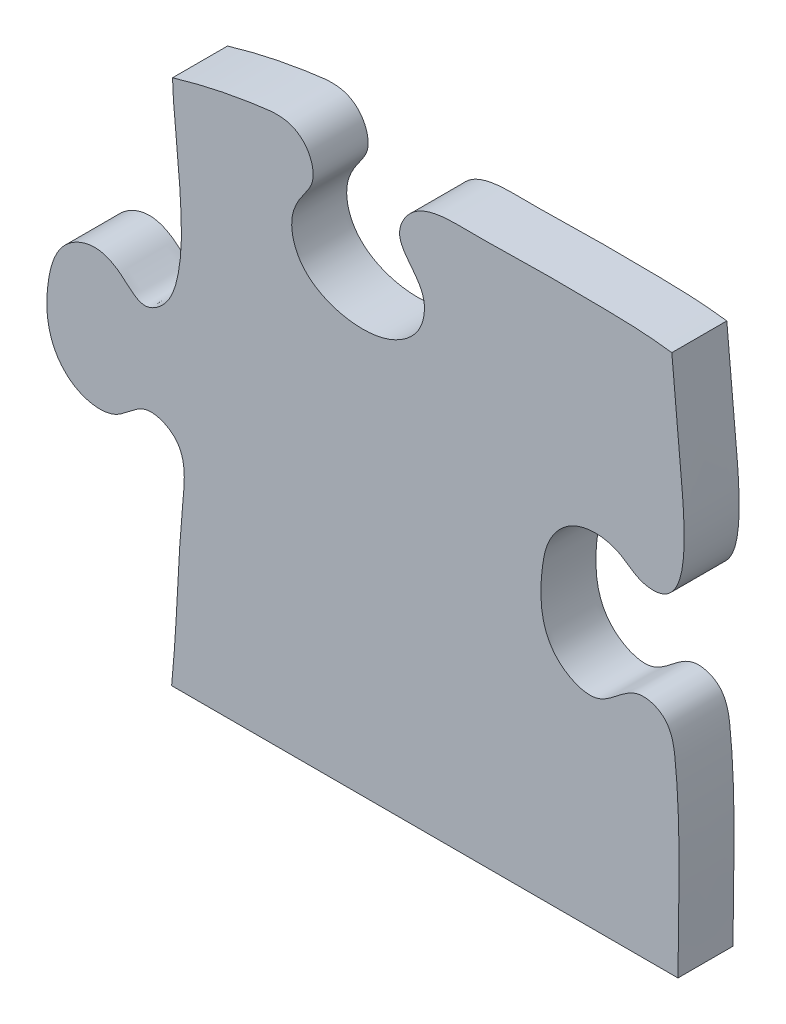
ISO-10303-21;
HEADER;
FILE_DESCRIPTION(('STEP AP214'),'2;1');
FILE_NAME('part.step','',(''),(''),'','','');
FILE_SCHEMA(('AUTOMOTIVE_DESIGN { 1 0 10303 214 1 1 1 1 }'));
ENDSEC;
DATA;
#1=APPLICATION_CONTEXT('core data for automotive mechanical design processes');
#2=APPLICATION_PROTOCOL_DEFINITION('international standard','automotive_design',2000,#1);
#3=PRODUCT_CONTEXT('',#1,'mechanical');
#4=PRODUCT('Part','Part','',(#3));
#5=PRODUCT_RELATED_PRODUCT_CATEGORY('part','',(#4));
#6=PRODUCT_DEFINITION_FORMATION('','',#4);
#7=PRODUCT_DEFINITION_CONTEXT('part definition',#1,'design');
#8=PRODUCT_DEFINITION('design','',#6,#7);
#9=PRODUCT_DEFINITION_SHAPE('','',#8);
#10=(LENGTH_UNIT() NAMED_UNIT(*) SI_UNIT(.MILLI.,.METRE.));
#11=(NAMED_UNIT(*) PLANE_ANGLE_UNIT() SI_UNIT($,.RADIAN.));
#12=(NAMED_UNIT(*) SI_UNIT($,.STERADIAN.) SOLID_ANGLE_UNIT());
#13=UNCERTAINTY_MEASURE_WITH_UNIT(LENGTH_MEASURE(1.E-05),#10,'distance_accuracy_value','');
#14=(GEOMETRIC_REPRESENTATION_CONTEXT(3) GLOBAL_UNCERTAINTY_ASSIGNED_CONTEXT((#13)) GLOBAL_UNIT_ASSIGNED_CONTEXT((#10,
#11,#12)) REPRESENTATION_CONTEXT('',''));
#15=CARTESIAN_POINT('',(0.,0.,0.));
#16=DIRECTION('',(0.,0.,1.));
#17=DIRECTION('',(1.,0.,0.));
#18=AXIS2_PLACEMENT_3D('',#15,#16,#17);
#19=CARTESIAN_POINT('',(164.700455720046,356.,-0.00999999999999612));
#20=CARTESIAN_POINT('',(166.684488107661,335.198470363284,-0.00999999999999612));
#21=CARTESIAN_POINT('',(165.501961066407,316.54844325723,-0.00999999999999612));
#22=CARTESIAN_POINT('',(164.960386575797,287.97241381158,-0.00999999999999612));
#23=CARTESIAN_POINT('',(152.647306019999,285.390744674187,-0.00999999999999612));
#24=CARTESIAN_POINT('',(146.755099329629,295.454986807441,-0.00999999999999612));
#25=CARTESIAN_POINT('',(133.057911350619,298.241097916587,-0.00999999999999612));
#26=CARTESIAN_POINT('',(118.543117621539,289.096389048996,-0.00999999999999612));
#27=CARTESIAN_POINT('',(110.066069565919,270.786201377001,-0.00999999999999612));
#28=CARTESIAN_POINT('',(115.81886117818,249.01949577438,-0.00999999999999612));
#29=CARTESIAN_POINT('',(132.43055469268,243.861484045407,-0.00999999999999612));
#30=CARTESIAN_POINT('',(145.190771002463,247.721589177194,-0.00999999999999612));
#31=CARTESIAN_POINT('',(150.073688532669,259.755128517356,-0.00999999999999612));
#32=CARTESIAN_POINT('',(164.873456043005,258.011209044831,-0.00999999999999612));
#33=CARTESIAN_POINT('',(166.852874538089,244.914449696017,-0.00999999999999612));
#34=CARTESIAN_POINT('',(165.64887314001,235.496089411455,-0.00999999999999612));
#35=CARTESIAN_POINT('',(164.287273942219,218.693357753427,-0.00999999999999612));
#36=CARTESIAN_POINT('',(162.190296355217,197.368034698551,-0.00999999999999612));
#37=CARTESIAN_POINT('',(156.3242571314,163.987545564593,-0.00999999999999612));
#38=CARTESIAN_POINT('',(154.411282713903,133.17643128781,-0.00999999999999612));
#39=CARTESIAN_POINT('',(156.534624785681,107.79955112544,-0.00999999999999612));
#40=CARTESIAN_POINT('',(165.683431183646,96.7362595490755,-0.00999999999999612));
#41=CARTESIAN_POINT('',(175.741034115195,97.7165246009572,-0.00999999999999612));
#42=CARTESIAN_POINT('',(178.913476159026,105.433342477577,-0.00999999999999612));
#43=CARTESIAN_POINT('',(187.788546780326,107.088038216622,-0.00999999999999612));
#44=CARTESIAN_POINT('',(196.945345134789,104.662624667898,-0.00999999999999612));
#45=CARTESIAN_POINT('',(205.29981235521,92.5405980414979,-0.00999999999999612));
#46=CARTESIAN_POINT('',(205.41693478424,76.2178133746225,-0.00999999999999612));
#47=CARTESIAN_POINT('',(199.239540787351,59.8870096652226,-0.00999999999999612));
#48=CARTESIAN_POINT('',(186.871281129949,54.774238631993,-0.00999999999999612));
#49=CARTESIAN_POINT('',(176.156697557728,56.844920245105,-0.00999999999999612));
#50=CARTESIAN_POINT('',(170.099360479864,65.2771221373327,-0.00999999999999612));
#51=CARTESIAN_POINT('',(157.970826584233,62.7514417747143,-0.00999999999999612));
#52=CARTESIAN_POINT('',(154.504441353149,46.6972732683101,-0.00999999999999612));
#53=CARTESIAN_POINT('',(156.826886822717,28.5222575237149,-0.00999999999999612));
#54=CARTESIAN_POINT('',(160.951813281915,-0.904965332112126,-0.00999999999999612));
#55=CARTESIAN_POINT('',(160.817443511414,-23.2712614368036,-0.00999999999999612));
#56=CARTESIAN_POINT('',(159.515162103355,-48.5242453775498,-0.00999999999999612));
#57=CARTESIAN_POINT('',(159.855435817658,-66.2012023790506,-0.00999999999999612));
#58=CARTESIAN_POINT('',(174.098925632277,-64.1326131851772,-0.00999999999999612));
#59=CARTESIAN_POINT('',(178.558905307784,-57.1982656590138,-0.00999999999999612));
#60=CARTESIAN_POINT('',(189.170801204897,-53.4758485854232,-0.00999999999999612));
#61=CARTESIAN_POINT('',(204.121791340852,-56.9229006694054,-0.00999999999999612));
#62=CARTESIAN_POINT('',(214.382314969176,-74.3254117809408,-0.00999999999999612));
#63=CARTESIAN_POINT('',(212.434433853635,-94.56819618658,-0.00999999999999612));
#64=CARTESIAN_POINT('',(198.400882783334,-105.927100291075,-0.00999999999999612));
#65=CARTESIAN_POINT('',(183.864051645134,-103.318484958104,-0.00999999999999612));
#66=CARTESIAN_POINT('',(177.484460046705,-92.9196706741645,-0.00999999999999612));
#67=CARTESIAN_POINT('',(166.612136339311,-90.3684772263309,-0.00999999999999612));
#68=CARTESIAN_POINT('',(160.072685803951,-95.573386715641,-0.00999999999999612));
#69=CARTESIAN_POINT('',(159.605088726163,-111.518801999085,-0.00999999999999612));
#70=CARTESIAN_POINT('',(161.971531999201,-132.152629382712,-0.00999999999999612));
#71=CARTESIAN_POINT('',(165.531009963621,-165.300059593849,-0.00999999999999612));
#72=CARTESIAN_POINT('',(167.927544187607,-195.365052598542,-0.00999999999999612));
#73=CARTESIAN_POINT('',(172.57489134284,-240.687787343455,-0.00999999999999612));
#74=CARTESIAN_POINT('',(151.998880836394,-237.677540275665,-0.00999999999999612));
#75=CARTESIAN_POINT('',(144.556929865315,-230.426442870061,-0.00999999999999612));
#76=CARTESIAN_POINT('',(127.822205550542,-229.966972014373,-0.00999999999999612));
#77=CARTESIAN_POINT('',(119.338975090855,-241.300441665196,-0.00999999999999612));
#78=CARTESIAN_POINT('',(116.55363668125,-259.024274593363,-0.00999999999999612));
#79=CARTESIAN_POINT('',(116.920126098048,-276.665079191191,-0.00999999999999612));
#80=CARTESIAN_POINT('',(139.807593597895,-286.808161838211,-0.00999999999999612));
#81=CARTESIAN_POINT('',(149.426451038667,-271.120437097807,-0.00999999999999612));
#82=CARTESIAN_POINT('',(164.833722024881,-276.098774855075,-0.00999999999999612));
#83=CARTESIAN_POINT('',(167.534498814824,-298.611176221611,-0.00999999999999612));
#84=CARTESIAN_POINT('',(167.66539945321,-324.44648435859,-0.00999999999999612));
#85=CARTESIAN_POINT('',(167.206886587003,-345.801767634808,-0.00999999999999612));
#86=CARTESIAN_POINT('',(167.126415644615,-356.,-0.00999999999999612));
#87=B_SPLINE_CURVE_WITH_KNOTS('',3,(#19,#20,#21,#22,#23,#24,#25,#26,#27,#28,#29,#30,#31,#32,#33,
#34,#35,#36,#37,#38,#39,#40,#41,#42,#43,#44,#45,#46,#47,#48,#49,#50,#51,#52,#53,#54,#55,#56,#57,
#58,#59,#60,#61,#62,#63,#64,#65,#66,#67,#68,#69,#70,#71,#72,#73,#74,#75,#76,#77,#78,#79,#80,#81,
#82,#83,#84,#85,#86),.UNSPECIFIED.,.F.,.F.,(4,1,1,1,1,1,1,1,1,1,1,1,1,1,1,1,1,1,1,1,1,1,1,1,1,1,
1,1,1,1,1,1,1,1,1,1,1,1,1,1,1,1,1,1,1,1,1,1,1,1,1,1,1,1,1,1,1,1,1,1,1,1,1,1,1,4),(0.,
0.0528861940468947,0.0611638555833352,0.0696733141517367,0.078438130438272,0.090018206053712,
0.103675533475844,0.122333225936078,0.142560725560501,0.155895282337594,0.165515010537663,
0.176439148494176,0.187171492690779,0.194785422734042,0.209132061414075,0.213814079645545,
0.241605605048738,0.267229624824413,0.306753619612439,0.326390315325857,0.335466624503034,
0.342457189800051,0.349640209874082,0.355564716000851,0.365339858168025,0.374043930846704,
0.393709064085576,0.408072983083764,0.418687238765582,0.427525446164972,0.43602306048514,
0.444515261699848,0.454494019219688,0.476412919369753,0.496275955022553,0.534624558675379,
0.541144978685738,0.561480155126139,0.567662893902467,0.574392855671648,0.583113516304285,
0.596680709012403,0.612912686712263,0.634082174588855,0.646626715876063,0.657822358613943,
0.669754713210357,0.678210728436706,0.685129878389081,0.689092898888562,0.71784093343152,
0.747115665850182,0.77522808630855,0.815611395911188,0.819725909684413,0.828398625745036,
0.84335213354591,0.85870373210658,0.863219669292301,0.888511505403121,0.901615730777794,
0.918667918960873,0.92637935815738,0.939283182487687,0.973955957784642,1.),.UNSPECIFIED.);
#88=DIRECTION('',(0.,0.,1.));
#89=VECTOR('',#88,1.);
#90=SURFACE_OF_LINEAR_EXTRUSION('',#87,#89);
#91=CARTESIAN_POINT('',(164.700455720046,356.,20.));
#92=CARTESIAN_POINT('',(166.684488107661,335.198470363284,20.));
#93=CARTESIAN_POINT('',(165.501961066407,316.54844325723,20.));
#94=CARTESIAN_POINT('',(164.960386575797,287.97241381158,20.));
#95=CARTESIAN_POINT('',(152.647306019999,285.390744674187,20.));
#96=CARTESIAN_POINT('',(146.755099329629,295.454986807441,20.));
#97=CARTESIAN_POINT('',(133.057911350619,298.241097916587,20.));
#98=CARTESIAN_POINT('',(118.543117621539,289.096389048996,20.));
#99=CARTESIAN_POINT('',(110.066069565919,270.786201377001,20.));
#100=CARTESIAN_POINT('',(115.81886117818,249.01949577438,20.));
#101=CARTESIAN_POINT('',(132.43055469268,243.861484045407,20.));
#102=CARTESIAN_POINT('',(145.190771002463,247.721589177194,20.));
#103=CARTESIAN_POINT('',(150.073688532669,259.755128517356,20.));
#104=CARTESIAN_POINT('',(164.873456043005,258.011209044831,20.));
#105=CARTESIAN_POINT('',(166.852874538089,244.914449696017,20.));
#106=CARTESIAN_POINT('',(165.64887314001,235.496089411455,20.));
#107=CARTESIAN_POINT('',(164.287273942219,218.693357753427,20.));
#108=CARTESIAN_POINT('',(162.190296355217,197.368034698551,20.));
#109=CARTESIAN_POINT('',(156.3242571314,163.987545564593,20.));
#110=CARTESIAN_POINT('',(154.411282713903,133.17643128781,20.));
#111=CARTESIAN_POINT('',(156.534624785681,107.79955112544,20.));
#112=CARTESIAN_POINT('',(165.683431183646,96.7362595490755,20.));
#113=CARTESIAN_POINT('',(175.741034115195,97.7165246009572,20.));
#114=CARTESIAN_POINT('',(178.913476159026,105.433342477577,20.));
#115=CARTESIAN_POINT('',(187.788546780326,107.088038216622,20.));
#116=CARTESIAN_POINT('',(196.945345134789,104.662624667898,20.));
#117=CARTESIAN_POINT('',(205.29981235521,92.5405980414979,20.));
#118=CARTESIAN_POINT('',(205.41693478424,76.2178133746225,20.));
#119=CARTESIAN_POINT('',(199.239540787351,59.8870096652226,20.));
#120=CARTESIAN_POINT('',(186.871281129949,54.774238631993,20.));
#121=CARTESIAN_POINT('',(176.156697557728,56.844920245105,20.));
#122=CARTESIAN_POINT('',(170.099360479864,65.2771221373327,20.));
#123=CARTESIAN_POINT('',(157.970826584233,62.7514417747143,20.));
#124=CARTESIAN_POINT('',(154.504441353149,46.6972732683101,20.));
#125=CARTESIAN_POINT('',(156.826886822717,28.5222575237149,20.));
#126=CARTESIAN_POINT('',(160.951813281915,-0.904965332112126,20.));
#127=CARTESIAN_POINT('',(160.817443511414,-23.2712614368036,20.));
#128=CARTESIAN_POINT('',(159.515162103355,-48.5242453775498,20.));
#129=CARTESIAN_POINT('',(159.855435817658,-66.2012023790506,20.));
#130=CARTESIAN_POINT('',(174.098925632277,-64.1326131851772,20.));
#131=CARTESIAN_POINT('',(178.558905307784,-57.1982656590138,20.));
#132=CARTESIAN_POINT('',(189.170801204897,-53.4758485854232,20.));
#133=CARTESIAN_POINT('',(204.121791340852,-56.9229006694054,20.));
#134=CARTESIAN_POINT('',(214.382314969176,-74.3254117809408,20.));
#135=CARTESIAN_POINT('',(212.434433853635,-94.56819618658,20.));
#136=CARTESIAN_POINT('',(198.400882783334,-105.927100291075,20.));
#137=CARTESIAN_POINT('',(183.864051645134,-103.318484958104,20.));
#138=CARTESIAN_POINT('',(177.484460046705,-92.9196706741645,20.));
#139=CARTESIAN_POINT('',(166.612136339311,-90.3684772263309,20.));
#140=CARTESIAN_POINT('',(160.072685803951,-95.573386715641,20.));
#141=CARTESIAN_POINT('',(159.605088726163,-111.518801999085,20.));
#142=CARTESIAN_POINT('',(161.971531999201,-132.152629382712,20.));
#143=CARTESIAN_POINT('',(165.531009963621,-165.300059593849,20.));
#144=CARTESIAN_POINT('',(167.927544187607,-195.365052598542,20.));
#145=CARTESIAN_POINT('',(172.57489134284,-240.687787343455,20.));
#146=CARTESIAN_POINT('',(151.998880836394,-237.677540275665,20.));
#147=CARTESIAN_POINT('',(144.556929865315,-230.426442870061,20.));
#148=CARTESIAN_POINT('',(127.822205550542,-229.966972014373,20.));
#149=CARTESIAN_POINT('',(119.338975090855,-241.300441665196,20.));
#150=CARTESIAN_POINT('',(116.55363668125,-259.024274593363,20.));
#151=CARTESIAN_POINT('',(116.920126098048,-276.665079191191,20.));
#152=CARTESIAN_POINT('',(139.807593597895,-286.808161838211,20.));
#153=CARTESIAN_POINT('',(149.426451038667,-271.120437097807,20.));
#154=CARTESIAN_POINT('',(164.833722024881,-276.098774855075,20.));
#155=CARTESIAN_POINT('',(167.534498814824,-298.611176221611,20.));
#156=CARTESIAN_POINT('',(167.66539945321,-324.44648435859,20.));
#157=CARTESIAN_POINT('',(167.206886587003,-345.801767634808,20.));
#158=CARTESIAN_POINT('',(167.126415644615,-356.,20.));
#159=B_SPLINE_CURVE_WITH_KNOTS('',3,(#91,#92,#93,#94,#95,#96,#97,#98,#99,#100,#101,#102,#103,
#104,#105,#106,#107,#108,#109,#110,#111,#112,#113,#114,#115,#116,#117,#118,#119,#120,#121,#122,
#123,#124,#125,#126,#127,#128,#129,#130,#131,#132,#133,#134,#135,#136,#137,#138,#139,#140,#141,
#142,#143,#144,#145,#146,#147,#148,#149,#150,#151,#152,#153,#154,#155,#156,#157,#158),
.UNSPECIFIED.,.F.,.F.,(4,1,1,1,1,1,1,1,1,1,1,1,1,1,1,1,1,1,1,1,1,1,1,1,1,1,1,1,1,1,1,1,1,1,1,1,
1,1,1,1,1,1,1,1,1,1,1,1,1,1,1,1,1,1,1,1,1,1,1,1,1,1,1,1,1,4),(0.,0.0528861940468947,
0.0611638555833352,0.0696733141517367,0.078438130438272,0.090018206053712,0.103675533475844,
0.122333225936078,0.142560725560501,0.155895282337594,0.165515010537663,0.176439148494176,
0.187171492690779,0.194785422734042,0.209132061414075,0.213814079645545,0.241605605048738,
0.267229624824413,0.306753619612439,0.326390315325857,0.335466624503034,0.342457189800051,
0.349640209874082,0.355564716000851,0.365339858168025,0.374043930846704,0.393709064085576,
0.408072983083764,0.418687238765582,0.427525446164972,0.43602306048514,0.444515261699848,
0.454494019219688,0.476412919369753,0.496275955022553,0.534624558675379,0.541144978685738,
0.561480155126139,0.567662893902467,0.574392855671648,0.583113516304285,0.596680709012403,
0.612912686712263,0.634082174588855,0.646626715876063,0.657822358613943,0.669754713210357,
0.678210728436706,0.685129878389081,0.689092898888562,0.71784093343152,0.747115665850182,
0.77522808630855,0.815611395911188,0.819725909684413,0.828398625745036,0.84335213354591,
0.85870373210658,0.863219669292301,0.888511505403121,0.901615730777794,0.918667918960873,
0.92637935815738,0.939283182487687,0.973955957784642,1.),.UNSPECIFIED.);
#160=CARTESIAN_POINT('',(164.89714626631,-160.138848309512,20.));
#161=VERTEX_POINT('',#160);
#162=CARTESIAN_POINT('',(167.126415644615,-356.,20.));
#163=VERTEX_POINT('',#162);
#164=EDGE_CURVE('E94',#161,#163,#159,.T.);
#165=ORIENTED_EDGE('',*,*,#164,.T.);
#166=DIRECTION('',(0.,0.,1.));
#167=VECTOR('',#166,1.);
#168=CARTESIAN_POINT('',(167.126415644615,-356.,-0.00999999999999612));
#169=LINE('',#168,#167);
#170=CARTESIAN_POINT('',(167.126415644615,-356.,0.));
#171=VERTEX_POINT('',#170);
#172=EDGE_CURVE('E148',#171,#163,#169,.T.);
#173=ORIENTED_EDGE('',*,*,#172,.F.);
#174=CARTESIAN_POINT('',(164.700455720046,356.,0.));
#175=CARTESIAN_POINT('',(166.684488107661,335.198470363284,0.));
#176=CARTESIAN_POINT('',(165.501961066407,316.54844325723,0.));
#177=CARTESIAN_POINT('',(164.960386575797,287.97241381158,0.));
#178=CARTESIAN_POINT('',(152.647306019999,285.390744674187,0.));
#179=CARTESIAN_POINT('',(146.755099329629,295.454986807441,0.));
#180=CARTESIAN_POINT('',(133.057911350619,298.241097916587,0.));
#181=CARTESIAN_POINT('',(118.543117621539,289.096389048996,0.));
#182=CARTESIAN_POINT('',(110.066069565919,270.786201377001,0.));
#183=CARTESIAN_POINT('',(115.81886117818,249.01949577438,0.));
#184=CARTESIAN_POINT('',(132.43055469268,243.861484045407,0.));
#185=CARTESIAN_POINT('',(145.190771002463,247.721589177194,0.));
#186=CARTESIAN_POINT('',(150.073688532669,259.755128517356,0.));
#187=CARTESIAN_POINT('',(164.873456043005,258.011209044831,0.));
#188=CARTESIAN_POINT('',(166.852874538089,244.914449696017,0.));
#189=CARTESIAN_POINT('',(165.64887314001,235.496089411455,0.));
#190=CARTESIAN_POINT('',(164.287273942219,218.693357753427,0.));
#191=CARTESIAN_POINT('',(162.190296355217,197.368034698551,0.));
#192=CARTESIAN_POINT('',(156.3242571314,163.987545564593,0.));
#193=CARTESIAN_POINT('',(154.411282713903,133.17643128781,0.));
#194=CARTESIAN_POINT('',(156.534624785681,107.79955112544,0.));
#195=CARTESIAN_POINT('',(165.683431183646,96.7362595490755,0.));
#196=CARTESIAN_POINT('',(175.741034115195,97.7165246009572,0.));
#197=CARTESIAN_POINT('',(178.913476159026,105.433342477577,0.));
#198=CARTESIAN_POINT('',(187.788546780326,107.088038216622,0.));
#199=CARTESIAN_POINT('',(196.945345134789,104.662624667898,0.));
#200=CARTESIAN_POINT('',(205.29981235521,92.5405980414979,0.));
#201=CARTESIAN_POINT('',(205.41693478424,76.2178133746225,0.));
#202=CARTESIAN_POINT('',(199.239540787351,59.8870096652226,0.));
#203=CARTESIAN_POINT('',(186.871281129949,54.774238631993,0.));
#204=CARTESIAN_POINT('',(176.156697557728,56.844920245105,0.));
#205=CARTESIAN_POINT('',(170.099360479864,65.2771221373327,0.));
#206=CARTESIAN_POINT('',(157.970826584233,62.7514417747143,0.));
#207=CARTESIAN_POINT('',(154.504441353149,46.6972732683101,0.));
#208=CARTESIAN_POINT('',(156.826886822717,28.5222575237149,0.));
#209=CARTESIAN_POINT('',(160.951813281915,-0.904965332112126,0.));
#210=CARTESIAN_POINT('',(160.817443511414,-23.2712614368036,0.));
#211=CARTESIAN_POINT('',(159.515162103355,-48.5242453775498,0.));
#212=CARTESIAN_POINT('',(159.855435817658,-66.2012023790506,0.));
#213=CARTESIAN_POINT('',(174.098925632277,-64.1326131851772,0.));
#214=CARTESIAN_POINT('',(178.558905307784,-57.1982656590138,0.));
#215=CARTESIAN_POINT('',(189.170801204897,-53.4758485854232,0.));
#216=CARTESIAN_POINT('',(204.121791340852,-56.9229006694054,0.));
#217=CARTESIAN_POINT('',(214.382314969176,-74.3254117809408,0.));
#218=CARTESIAN_POINT('',(212.434433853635,-94.56819618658,0.));
#219=CARTESIAN_POINT('',(198.400882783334,-105.927100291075,0.));
#220=CARTESIAN_POINT('',(183.864051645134,-103.318484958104,0.));
#221=CARTESIAN_POINT('',(177.484460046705,-92.9196706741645,0.));
#222=CARTESIAN_POINT('',(166.612136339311,-90.3684772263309,0.));
#223=CARTESIAN_POINT('',(160.072685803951,-95.573386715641,0.));
#224=CARTESIAN_POINT('',(159.605088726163,-111.518801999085,0.));
#225=CARTESIAN_POINT('',(161.971531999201,-132.152629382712,0.));
#226=CARTESIAN_POINT('',(165.531009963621,-165.300059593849,0.));
#227=CARTESIAN_POINT('',(167.927544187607,-195.365052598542,0.));
#228=CARTESIAN_POINT('',(172.57489134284,-240.687787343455,0.));
#229=CARTESIAN_POINT('',(151.998880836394,-237.677540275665,0.));
#230=CARTESIAN_POINT('',(144.556929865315,-230.426442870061,0.));
#231=CARTESIAN_POINT('',(127.822205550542,-229.966972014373,0.));
#232=CARTESIAN_POINT('',(119.338975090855,-241.300441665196,0.));
#233=CARTESIAN_POINT('',(116.55363668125,-259.024274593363,0.));
#234=CARTESIAN_POINT('',(116.920126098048,-276.665079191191,0.));
#235=CARTESIAN_POINT('',(139.807593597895,-286.808161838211,0.));
#236=CARTESIAN_POINT('',(149.426451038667,-271.120437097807,0.));
#237=CARTESIAN_POINT('',(164.833722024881,-276.098774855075,0.));
#238=CARTESIAN_POINT('',(167.534498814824,-298.611176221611,0.));
#239=CARTESIAN_POINT('',(167.66539945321,-324.44648435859,0.));
#240=CARTESIAN_POINT('',(167.206886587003,-345.801767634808,0.));
#241=CARTESIAN_POINT('',(167.126415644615,-356.,0.));
#242=B_SPLINE_CURVE_WITH_KNOTS('',3,(#174,#175,#176,#177,#178,#179,#180,#181,#182,#183,#184,
#185,#186,#187,#188,#189,#190,#191,#192,#193,#194,#195,#196,#197,#198,#199,#200,#201,#202,#203,
#204,#205,#206,#207,#208,#209,#210,#211,#212,#213,#214,#215,#216,#217,#218,#219,#220,#221,#222,
#223,#224,#225,#226,#227,#228,#229,#230,#231,#232,#233,#234,#235,#236,#237,#238,#239,#240,#241),
.UNSPECIFIED.,.F.,.F.,(4,1,1,1,1,1,1,1,1,1,1,1,1,1,1,1,1,1,1,1,1,1,1,1,1,1,1,1,1,1,1,1,1,1,1,1,
1,1,1,1,1,1,1,1,1,1,1,1,1,1,1,1,1,1,1,1,1,1,1,1,1,1,1,1,1,4),(0.,0.0528861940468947,
0.0611638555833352,0.0696733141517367,0.078438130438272,0.090018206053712,0.103675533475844,
0.122333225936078,0.142560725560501,0.155895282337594,0.165515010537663,0.176439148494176,
0.187171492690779,0.194785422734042,0.209132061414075,0.213814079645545,0.241605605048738,
0.267229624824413,0.306753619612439,0.326390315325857,0.335466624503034,0.342457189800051,
0.349640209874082,0.355564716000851,0.365339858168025,0.374043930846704,0.393709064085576,
0.408072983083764,0.418687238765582,0.427525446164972,0.43602306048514,0.444515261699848,
0.454494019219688,0.476412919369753,0.496275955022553,0.534624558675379,0.541144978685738,
0.561480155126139,0.567662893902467,0.574392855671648,0.583113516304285,0.596680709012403,
0.612912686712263,0.634082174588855,0.646626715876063,0.657822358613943,0.669754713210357,
0.678210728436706,0.685129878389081,0.689092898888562,0.71784093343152,0.747115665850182,
0.77522808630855,0.815611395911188,0.819725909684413,0.828398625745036,0.84335213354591,
0.85870373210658,0.863219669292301,0.888511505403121,0.901615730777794,0.918667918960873,
0.92637935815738,0.939283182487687,0.973955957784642,1.),.UNSPECIFIED.);
#243=CARTESIAN_POINT('',(164.89714626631,-160.138848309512,0.));
#244=VERTEX_POINT('',#243);
#245=EDGE_CURVE('E59',#244,#171,#242,.T.);
#246=ORIENTED_EDGE('',*,*,#245,.F.);
#247=DIRECTION('',(0.,0.,1.));
#248=VECTOR('',#247,1.);
#249=CARTESIAN_POINT('',(164.89714626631,-160.138848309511,-0.00999999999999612));
#250=LINE('',#249,#248);
#251=EDGE_CURVE('E52',#161,#244,#250,.F.);
#252=ORIENTED_EDGE('',*,*,#251,.F.);
#253=EDGE_LOOP('',(#165,#173,#246,#252));
#254=FACE_BOUND('',#253,.T.);
#255=ADVANCED_FACE('F34',(#254),#90,.F.);
#256=CARTESIAN_POINT('',(-9.39078729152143,356.,-0.00999999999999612));
#257=CARTESIAN_POINT('',(-10.6420004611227,342.109118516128,-0.00999999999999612));
#258=CARTESIAN_POINT('',(-14.6613121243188,319.56927935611,-0.00999999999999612));
#259=CARTESIAN_POINT('',(-17.4473947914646,293.08555207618,-0.00999999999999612));
#260=CARTESIAN_POINT('',(-13.8884373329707,273.667988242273,-0.00999999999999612));
#261=CARTESIAN_POINT('',(-1.07625820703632,271.397705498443,-0.00999999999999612));
#262=CARTESIAN_POINT('',(5.29309239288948,278.450722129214,-0.00999999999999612));
#263=CARTESIAN_POINT('',(14.9258759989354,283.741247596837,-0.00999999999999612));
#264=CARTESIAN_POINT('',(28.790892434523,278.335723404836,-0.00999999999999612));
#265=CARTESIAN_POINT('',(34.7382562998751,261.206713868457,-0.00999999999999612));
#266=CARTESIAN_POINT('',(33.1132905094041,240.122633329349,-0.00999999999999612));
#267=CARTESIAN_POINT('',(14.6676977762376,229.968331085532,-0.00999999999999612));
#268=CARTESIAN_POINT('',(3.42611827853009,235.442407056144,-0.00999999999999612));
#269=CARTESIAN_POINT('',(-2.96249564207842,240.393740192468,-0.00999999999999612));
#270=CARTESIAN_POINT('',(-18.0780076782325,240.138784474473,-0.00999999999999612));
#271=CARTESIAN_POINT('',(-18.5399667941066,222.992463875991,-0.00999999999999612));
#272=CARTESIAN_POINT('',(-17.4385931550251,202.827665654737,-0.00999999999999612));
#273=CARTESIAN_POINT('',(-14.0858554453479,190.221137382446,-0.00999999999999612));
#274=CARTESIAN_POINT('',(-15.5193743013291,175.136568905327,-0.00999999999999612));
#275=CARTESIAN_POINT('',(-16.6888175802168,157.648124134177,-0.00999999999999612));
#276=CARTESIAN_POINT('',(-17.7707660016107,144.240131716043,-0.00999999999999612));
#277=CARTESIAN_POINT('',(-17.3940925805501,124.109890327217,-0.00999999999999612));
#278=CARTESIAN_POINT('',(-18.6861496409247,110.985540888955,-0.00999999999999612));
#279=CARTESIAN_POINT('',(-3.94695866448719,101.126063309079,-0.00999999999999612));
#280=CARTESIAN_POINT('',(4.50824278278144,111.148466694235,-0.00999999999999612));
#281=CARTESIAN_POINT('',(13.1578407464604,120.870763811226,-0.00999999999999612));
#282=CARTESIAN_POINT('',(29.968112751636,122.314288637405,-0.00999999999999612));
#283=CARTESIAN_POINT('',(40.7223803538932,110.783826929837,-0.00999999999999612));
#284=CARTESIAN_POINT('',(45.7909417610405,94.3968136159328,-0.00999999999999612));
#285=CARTESIAN_POINT('',(43.9390810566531,75.8787758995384,-0.00999999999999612));
#286=CARTESIAN_POINT('',(30.503103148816,62.5847389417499,-0.00999999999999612));
#287=CARTESIAN_POINT('',(14.6986660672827,64.8647821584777,-0.00999999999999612));
#288=CARTESIAN_POINT('',(6.48631275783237,74.2887035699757,-0.00999999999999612));
#289=CARTESIAN_POINT('',(-2.74495882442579,80.3019272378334,-0.00999999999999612));
#290=CARTESIAN_POINT('',(-19.8840521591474,73.8019115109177,-0.00999999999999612));
#291=CARTESIAN_POINT('',(-15.1166354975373,44.269693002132,-0.00999999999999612));
#292=CARTESIAN_POINT('',(-13.5094217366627,17.7920418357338,-0.00999999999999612));
#293=CARTESIAN_POINT('',(-10.2430798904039,-1.06342782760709,-0.00999999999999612));
#294=CARTESIAN_POINT('',(-6.15123504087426,-23.5391381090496,-0.00999999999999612));
#295=CARTESIAN_POINT('',(-4.12992604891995,-48.8436757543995,-0.00999999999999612));
#296=CARTESIAN_POINT('',(-23.2142462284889,-47.7574601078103,-0.00999999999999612));
#297=CARTESIAN_POINT('',(-30.0018234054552,-40.5423137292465,-0.00999999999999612));
#298=CARTESIAN_POINT('',(-42.7528213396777,-39.1853410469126,-0.00999999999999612));
#299=CARTESIAN_POINT('',(-57.5092962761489,-47.8418744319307,-0.00999999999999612));
#300=CARTESIAN_POINT('',(-60.2210733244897,-67.5138769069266,-0.00999999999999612));
#301=CARTESIAN_POINT('',(-54.0018378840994,-88.1567638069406,-0.00999999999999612));
#302=CARTESIAN_POINT('',(-33.5101255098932,-90.2818581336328,-0.00999999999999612));
#303=CARTESIAN_POINT('',(-26.938266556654,-78.8436195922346,-0.00999999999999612));
#304=CARTESIAN_POINT('',(-16.0575989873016,-79.9605650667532,-0.00999999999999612));
#305=CARTESIAN_POINT('',(-9.29054500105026,-89.9843542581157,-0.00999999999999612));
#306=CARTESIAN_POINT('',(-9.26037942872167,-106.547726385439,-0.00999999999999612));
#307=CARTESIAN_POINT('',(-10.8655976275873,-129.908253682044,-0.00999999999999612));
#308=CARTESIAN_POINT('',(-18.080355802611,-155.05589418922,-0.00999999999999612));
#309=CARTESIAN_POINT('',(-15.5015350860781,-180.564325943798,-0.00999999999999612));
#310=CARTESIAN_POINT('',(-13.4534563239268,-202.72625863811,-0.00999999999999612));
#311=CARTESIAN_POINT('',(-13.0721771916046,-222.761537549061,-0.00999999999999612));
#312=CARTESIAN_POINT('',(-18.0801009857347,-237.162246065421,-0.00999999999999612));
#313=CARTESIAN_POINT('',(-28.3640065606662,-243.264641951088,-0.00999999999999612));
#314=CARTESIAN_POINT('',(-35.3195309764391,-234.565632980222,-0.00999999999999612));
#315=CARTESIAN_POINT('',(-45.5220607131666,-230.442721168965,-0.00999999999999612));
#316=CARTESIAN_POINT('',(-58.2826152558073,-236.227844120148,-0.00999999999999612));
#317=CARTESIAN_POINT('',(-63.2505187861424,-252.690663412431,-0.00999999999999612));
#318=CARTESIAN_POINT('',(-62.4331763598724,-269.758175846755,-0.00999999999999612));
#319=CARTESIAN_POINT('',(-51.5712190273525,-281.475483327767,-0.00999999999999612));
#320=CARTESIAN_POINT('',(-36.6120763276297,-283.519302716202,-0.00999999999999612));
#321=CARTESIAN_POINT('',(-27.825780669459,-270.933950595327,-0.00999999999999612));
#322=CARTESIAN_POINT('',(-10.9923291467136,-277.705324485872,-0.00999999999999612));
#323=CARTESIAN_POINT('',(-14.9884890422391,-312.557066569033,-0.00999999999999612));
#324=CARTESIAN_POINT('',(-14.8626828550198,-333.640060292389,-0.00999999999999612));
#325=CARTESIAN_POINT('',(-17.0261941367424,-356.,-0.00999999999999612));
#326=B_SPLINE_CURVE_WITH_KNOTS('',3,(#256,#257,#258,#259,#260,#261,#262,#263,#264,#265,#266,
#267,#268,#269,#270,#271,#272,#273,#274,#275,#276,#277,#278,#279,#280,#281,#282,#283,#284,#285,
#286,#287,#288,#289,#290,#291,#292,#293,#294,#295,#296,#297,#298,#299,#300,#301,#302,#303,#304,
#305,#306,#307,#308,#309,#310,#311,#312,#313,#314,#315,#316,#317,#318,#319,#320,#321,#322,#323,
#324,#325),.UNSPECIFIED.,.F.,.F.,(4,1,1,1,1,1,1,1,1,1,1,1,1,1,1,1,1,1,1,1,1,1,1,1,1,1,1,1,1,1,1,
1,1,1,1,1,1,1,1,1,1,1,1,1,1,1,1,1,1,1,1,1,1,1,1,1,1,1,1,1,1,1,1,1,1,1,1,4),(0.,
0.0382435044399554,0.06014267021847,0.0759154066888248,0.0830880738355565,0.0898528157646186,
0.100420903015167,0.110971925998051,0.125303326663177,0.146622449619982,0.16313068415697,
0.171984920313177,0.178976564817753,0.184846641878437,0.208558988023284,0.213294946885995,
0.232206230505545,0.247690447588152,0.25282597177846,0.280146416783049,0.285652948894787,
0.304476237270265,0.313783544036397,0.32377706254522,0.334253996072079,0.350240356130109,
0.361652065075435,0.37428972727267,0.396319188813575,0.408299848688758,0.421251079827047,
0.43387737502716,0.442611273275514,0.448402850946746,0.478919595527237,0.50340807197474,
0.525599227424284,0.531488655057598,0.562302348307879,0.569309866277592,0.576593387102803,
0.588291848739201,0.600948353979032,0.618957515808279,0.638096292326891,0.652011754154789,
0.663601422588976,0.667955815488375,0.679319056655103,0.692000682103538,0.712742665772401,
0.742765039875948,0.761777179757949,0.781638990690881,0.803327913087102,0.815753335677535,
0.82139602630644,0.831491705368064,0.840302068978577,0.85029925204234,0.865053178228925,
0.884091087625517,0.893653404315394,0.906570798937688,0.918850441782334,0.928550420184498,
0.945628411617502,1.),.UNSPECIFIED.);
#327=DIRECTION('',(0.,0.,1.));
#328=VECTOR('',#327,1.);
#329=SURFACE_OF_LINEAR_EXTRUSION('',#326,#328);
#330=CARTESIAN_POINT('',(-9.39078729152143,356.,20.));
#331=CARTESIAN_POINT('',(-10.6420004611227,342.109118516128,20.));
#332=CARTESIAN_POINT('',(-14.6613121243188,319.56927935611,20.));
#333=CARTESIAN_POINT('',(-17.4473947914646,293.08555207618,20.));
#334=CARTESIAN_POINT('',(-13.8884373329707,273.667988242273,20.));
#335=CARTESIAN_POINT('',(-1.07625820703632,271.397705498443,20.));
#336=CARTESIAN_POINT('',(5.29309239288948,278.450722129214,20.));
#337=CARTESIAN_POINT('',(14.9258759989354,283.741247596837,20.));
#338=CARTESIAN_POINT('',(28.790892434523,278.335723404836,20.));
#339=CARTESIAN_POINT('',(34.7382562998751,261.206713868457,20.));
#340=CARTESIAN_POINT('',(33.1132905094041,240.122633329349,20.));
#341=CARTESIAN_POINT('',(14.6676977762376,229.968331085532,20.));
#342=CARTESIAN_POINT('',(3.42611827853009,235.442407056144,20.));
#343=CARTESIAN_POINT('',(-2.96249564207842,240.393740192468,20.));
#344=CARTESIAN_POINT('',(-18.0780076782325,240.138784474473,20.));
#345=CARTESIAN_POINT('',(-18.5399667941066,222.992463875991,20.));
#346=CARTESIAN_POINT('',(-17.4385931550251,202.827665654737,20.));
#347=CARTESIAN_POINT('',(-14.0858554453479,190.221137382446,20.));
#348=CARTESIAN_POINT('',(-15.5193743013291,175.136568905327,20.));
#349=CARTESIAN_POINT('',(-16.6888175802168,157.648124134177,20.));
#350=CARTESIAN_POINT('',(-17.7707660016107,144.240131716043,20.));
#351=CARTESIAN_POINT('',(-17.3940925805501,124.109890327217,20.));
#352=CARTESIAN_POINT('',(-18.6861496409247,110.985540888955,20.));
#353=CARTESIAN_POINT('',(-3.94695866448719,101.126063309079,20.));
#354=CARTESIAN_POINT('',(4.50824278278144,111.148466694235,20.));
#355=CARTESIAN_POINT('',(13.1578407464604,120.870763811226,20.));
#356=CARTESIAN_POINT('',(29.968112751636,122.314288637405,20.));
#357=CARTESIAN_POINT('',(40.7223803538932,110.783826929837,20.));
#358=CARTESIAN_POINT('',(45.7909417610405,94.3968136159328,20.));
#359=CARTESIAN_POINT('',(43.9390810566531,75.8787758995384,20.));
#360=CARTESIAN_POINT('',(30.503103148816,62.5847389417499,20.));
#361=CARTESIAN_POINT('',(14.6986660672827,64.8647821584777,20.));
#362=CARTESIAN_POINT('',(6.48631275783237,74.2887035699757,20.));
#363=CARTESIAN_POINT('',(-2.74495882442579,80.3019272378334,20.));
#364=CARTESIAN_POINT('',(-19.8840521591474,73.8019115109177,20.));
#365=CARTESIAN_POINT('',(-15.1166354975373,44.269693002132,20.));
#366=CARTESIAN_POINT('',(-13.5094217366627,17.7920418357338,20.));
#367=CARTESIAN_POINT('',(-10.2430798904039,-1.06342782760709,20.));
#368=CARTESIAN_POINT('',(-6.15123504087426,-23.5391381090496,20.));
#369=CARTESIAN_POINT('',(-4.12992604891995,-48.8436757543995,20.));
#370=CARTESIAN_POINT('',(-23.2142462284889,-47.7574601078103,20.));
#371=CARTESIAN_POINT('',(-30.0018234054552,-40.5423137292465,20.));
#372=CARTESIAN_POINT('',(-42.7528213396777,-39.1853410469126,20.));
#373=CARTESIAN_POINT('',(-57.5092962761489,-47.8418744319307,20.));
#374=CARTESIAN_POINT('',(-60.2210733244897,-67.5138769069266,20.));
#375=CARTESIAN_POINT('',(-54.0018378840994,-88.1567638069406,20.));
#376=CARTESIAN_POINT('',(-33.5101255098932,-90.2818581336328,20.));
#377=CARTESIAN_POINT('',(-26.938266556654,-78.8436195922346,20.));
#378=CARTESIAN_POINT('',(-16.0575989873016,-79.9605650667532,20.));
#379=CARTESIAN_POINT('',(-9.29054500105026,-89.9843542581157,20.));
#380=CARTESIAN_POINT('',(-9.26037942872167,-106.547726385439,20.));
#381=CARTESIAN_POINT('',(-10.8655976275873,-129.908253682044,20.));
#382=CARTESIAN_POINT('',(-18.080355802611,-155.05589418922,20.));
#383=CARTESIAN_POINT('',(-15.5015350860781,-180.564325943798,20.));
#384=CARTESIAN_POINT('',(-13.4534563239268,-202.72625863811,20.));
#385=CARTESIAN_POINT('',(-13.0721771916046,-222.761537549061,20.));
#386=CARTESIAN_POINT('',(-18.0801009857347,-237.162246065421,20.));
#387=CARTESIAN_POINT('',(-28.3640065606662,-243.264641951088,20.));
#388=CARTESIAN_POINT('',(-35.3195309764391,-234.565632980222,20.));
#389=CARTESIAN_POINT('',(-45.5220607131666,-230.442721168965,20.));
#390=CARTESIAN_POINT('',(-58.2826152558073,-236.227844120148,20.));
#391=CARTESIAN_POINT('',(-63.2505187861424,-252.690663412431,20.));
#392=CARTESIAN_POINT('',(-62.4331763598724,-269.758175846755,20.));
#393=CARTESIAN_POINT('',(-51.5712190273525,-281.475483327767,20.));
#394=CARTESIAN_POINT('',(-36.6120763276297,-283.519302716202,20.));
#395=CARTESIAN_POINT('',(-27.825780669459,-270.933950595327,20.));
#396=CARTESIAN_POINT('',(-10.9923291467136,-277.705324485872,20.));
#397=CARTESIAN_POINT('',(-14.9884890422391,-312.557066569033,20.));
#398=CARTESIAN_POINT('',(-14.8626828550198,-333.640060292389,20.));
#399=CARTESIAN_POINT('',(-17.0261941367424,-356.,20.));
#400=B_SPLINE_CURVE_WITH_KNOTS('',3,(#330,#331,#332,#333,#334,#335,#336,#337,#338,#339,#340,
#341,#342,#343,#344,#345,#346,#347,#348,#349,#350,#351,#352,#353,#354,#355,#356,#357,#358,#359,
#360,#361,#362,#363,#364,#365,#366,#367,#368,#369,#370,#371,#372,#373,#374,#375,#376,#377,#378,
#379,#380,#381,#382,#383,#384,#385,#386,#387,#388,#389,#390,#391,#392,#393,#394,#395,#396,#397,
#398,#399),.UNSPECIFIED.,.F.,.F.,(4,1,1,1,1,1,1,1,1,1,1,1,1,1,1,1,1,1,1,1,1,1,1,1,1,1,1,1,1,1,1,
1,1,1,1,1,1,1,1,1,1,1,1,1,1,1,1,1,1,1,1,1,1,1,1,1,1,1,1,1,1,1,1,1,1,1,1,4),(0.,
0.0382435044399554,0.06014267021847,0.0759154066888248,0.0830880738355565,0.0898528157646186,
0.100420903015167,0.110971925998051,0.125303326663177,0.146622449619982,0.16313068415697,
0.171984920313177,0.178976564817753,0.184846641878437,0.208558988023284,0.213294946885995,
0.232206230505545,0.247690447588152,0.25282597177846,0.280146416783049,0.285652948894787,
0.304476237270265,0.313783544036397,0.32377706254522,0.334253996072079,0.350240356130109,
0.361652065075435,0.37428972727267,0.396319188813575,0.408299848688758,0.421251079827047,
0.43387737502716,0.442611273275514,0.448402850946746,0.478919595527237,0.50340807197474,
0.525599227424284,0.531488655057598,0.562302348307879,0.569309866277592,0.576593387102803,
0.588291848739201,0.600948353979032,0.618957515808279,0.638096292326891,0.652011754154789,
0.663601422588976,0.667955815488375,0.679319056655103,0.692000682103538,0.712742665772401,
0.742765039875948,0.761777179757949,0.781638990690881,0.803327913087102,0.815753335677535,
0.82139602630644,0.831491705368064,0.840302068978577,0.85029925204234,0.865053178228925,
0.884091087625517,0.893653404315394,0.906570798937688,0.918850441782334,0.928550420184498,
0.945628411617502,1.),.UNSPECIFIED.);
#401=CARTESIAN_POINT('',(-16.6986782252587,-164.35007147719,20.));
#402=VERTEX_POINT('',#401);
#403=CARTESIAN_POINT('',(-17.0261941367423,-356.,20.));
#404=VERTEX_POINT('',#403);
#405=EDGE_CURVE('E87',#402,#404,#400,.T.);
#406=ORIENTED_EDGE('',*,*,#405,.F.);
#407=DIRECTION('',(0.,0.,1.));
#408=VECTOR('',#407,1.);
#409=CARTESIAN_POINT('',(-16.6986782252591,-164.350071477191,-0.00999999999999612));
#410=LINE('',#409,#408);
#411=CARTESIAN_POINT('',(-16.6986782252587,-164.35007147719,0.));
#412=VERTEX_POINT('',#411);
#413=EDGE_CURVE('E78',#402,#412,#410,.F.);
#414=ORIENTED_EDGE('',*,*,#413,.T.);
#415=CARTESIAN_POINT('',(-9.39078729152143,356.,0.));
#416=CARTESIAN_POINT('',(-10.6420004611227,342.109118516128,0.));
#417=CARTESIAN_POINT('',(-14.6613121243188,319.56927935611,0.));
#418=CARTESIAN_POINT('',(-17.4473947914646,293.08555207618,0.));
#419=CARTESIAN_POINT('',(-13.8884373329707,273.667988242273,0.));
#420=CARTESIAN_POINT('',(-1.07625820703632,271.397705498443,0.));
#421=CARTESIAN_POINT('',(5.29309239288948,278.450722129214,0.));
#422=CARTESIAN_POINT('',(14.9258759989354,283.741247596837,0.));
#423=CARTESIAN_POINT('',(28.790892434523,278.335723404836,0.));
#424=CARTESIAN_POINT('',(34.7382562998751,261.206713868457,0.));
#425=CARTESIAN_POINT('',(33.1132905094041,240.122633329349,0.));
#426=CARTESIAN_POINT('',(14.6676977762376,229.968331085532,0.));
#427=CARTESIAN_POINT('',(3.42611827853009,235.442407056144,0.));
#428=CARTESIAN_POINT('',(-2.96249564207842,240.393740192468,0.));
#429=CARTESIAN_POINT('',(-18.0780076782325,240.138784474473,0.));
#430=CARTESIAN_POINT('',(-18.5399667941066,222.992463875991,0.));
#431=CARTESIAN_POINT('',(-17.4385931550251,202.827665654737,0.));
#432=CARTESIAN_POINT('',(-14.0858554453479,190.221137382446,0.));
#433=CARTESIAN_POINT('',(-15.5193743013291,175.136568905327,0.));
#434=CARTESIAN_POINT('',(-16.6888175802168,157.648124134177,0.));
#435=CARTESIAN_POINT('',(-17.7707660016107,144.240131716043,0.));
#436=CARTESIAN_POINT('',(-17.3940925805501,124.109890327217,0.));
#437=CARTESIAN_POINT('',(-18.6861496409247,110.985540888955,0.));
#438=CARTESIAN_POINT('',(-3.94695866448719,101.126063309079,0.));
#439=CARTESIAN_POINT('',(4.50824278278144,111.148466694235,0.));
#440=CARTESIAN_POINT('',(13.1578407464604,120.870763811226,0.));
#441=CARTESIAN_POINT('',(29.968112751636,122.314288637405,0.));
#442=CARTESIAN_POINT('',(40.7223803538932,110.783826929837,0.));
#443=CARTESIAN_POINT('',(45.7909417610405,94.3968136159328,0.));
#444=CARTESIAN_POINT('',(43.9390810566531,75.8787758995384,0.));
#445=CARTESIAN_POINT('',(30.503103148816,62.5847389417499,0.));
#446=CARTESIAN_POINT('',(14.6986660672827,64.8647821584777,0.));
#447=CARTESIAN_POINT('',(6.48631275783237,74.2887035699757,0.));
#448=CARTESIAN_POINT('',(-2.74495882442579,80.3019272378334,0.));
#449=CARTESIAN_POINT('',(-19.8840521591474,73.8019115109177,0.));
#450=CARTESIAN_POINT('',(-15.1166354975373,44.269693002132,0.));
#451=CARTESIAN_POINT('',(-13.5094217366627,17.7920418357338,0.));
#452=CARTESIAN_POINT('',(-10.2430798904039,-1.06342782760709,0.));
#453=CARTESIAN_POINT('',(-6.15123504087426,-23.5391381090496,0.));
#454=CARTESIAN_POINT('',(-4.12992604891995,-48.8436757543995,0.));
#455=CARTESIAN_POINT('',(-23.2142462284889,-47.7574601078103,0.));
#456=CARTESIAN_POINT('',(-30.0018234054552,-40.5423137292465,0.));
#457=CARTESIAN_POINT('',(-42.7528213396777,-39.1853410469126,0.));
#458=CARTESIAN_POINT('',(-57.5092962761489,-47.8418744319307,0.));
#459=CARTESIAN_POINT('',(-60.2210733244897,-67.5138769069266,0.));
#460=CARTESIAN_POINT('',(-54.0018378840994,-88.1567638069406,0.));
#461=CARTESIAN_POINT('',(-33.5101255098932,-90.2818581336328,0.));
#462=CARTESIAN_POINT('',(-26.938266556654,-78.8436195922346,0.));
#463=CARTESIAN_POINT('',(-16.0575989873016,-79.9605650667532,0.));
#464=CARTESIAN_POINT('',(-9.29054500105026,-89.9843542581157,0.));
#465=CARTESIAN_POINT('',(-9.26037942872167,-106.547726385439,0.));
#466=CARTESIAN_POINT('',(-10.8655976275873,-129.908253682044,0.));
#467=CARTESIAN_POINT('',(-18.080355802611,-155.05589418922,0.));
#468=CARTESIAN_POINT('',(-15.5015350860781,-180.564325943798,0.));
#469=CARTESIAN_POINT('',(-13.4534563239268,-202.72625863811,0.));
#470=CARTESIAN_POINT('',(-13.0721771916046,-222.761537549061,0.));
#471=CARTESIAN_POINT('',(-18.0801009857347,-237.162246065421,0.));
#472=CARTESIAN_POINT('',(-28.3640065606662,-243.264641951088,0.));
#473=CARTESIAN_POINT('',(-35.3195309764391,-234.565632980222,0.));
#474=CARTESIAN_POINT('',(-45.5220607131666,-230.442721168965,0.));
#475=CARTESIAN_POINT('',(-58.2826152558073,-236.227844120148,0.));
#476=CARTESIAN_POINT('',(-63.2505187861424,-252.690663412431,0.));
#477=CARTESIAN_POINT('',(-62.4331763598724,-269.758175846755,0.));
#478=CARTESIAN_POINT('',(-51.5712190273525,-281.475483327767,0.));
#479=CARTESIAN_POINT('',(-36.6120763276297,-283.519302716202,0.));
#480=CARTESIAN_POINT('',(-27.825780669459,-270.933950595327,0.));
#481=CARTESIAN_POINT('',(-10.9923291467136,-277.705324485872,0.));
#482=CARTESIAN_POINT('',(-14.9884890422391,-312.557066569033,0.));
#483=CARTESIAN_POINT('',(-14.8626828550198,-333.640060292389,0.));
#484=CARTESIAN_POINT('',(-17.0261941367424,-356.,0.));
#485=B_SPLINE_CURVE_WITH_KNOTS('',3,(#415,#416,#417,#418,#419,#420,#421,#422,#423,#424,#425,
#426,#427,#428,#429,#430,#431,#432,#433,#434,#435,#436,#437,#438,#439,#440,#441,#442,#443,#444,
#445,#446,#447,#448,#449,#450,#451,#452,#453,#454,#455,#456,#457,#458,#459,#460,#461,#462,#463,
#464,#465,#466,#467,#468,#469,#470,#471,#472,#473,#474,#475,#476,#477,#478,#479,#480,#481,#482,
#483,#484),.UNSPECIFIED.,.F.,.F.,(4,1,1,1,1,1,1,1,1,1,1,1,1,1,1,1,1,1,1,1,1,1,1,1,1,1,1,1,1,1,1,
1,1,1,1,1,1,1,1,1,1,1,1,1,1,1,1,1,1,1,1,1,1,1,1,1,1,1,1,1,1,1,1,1,1,1,1,4),(0.,
0.0382435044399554,0.06014267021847,0.0759154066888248,0.0830880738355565,0.0898528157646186,
0.100420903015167,0.110971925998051,0.125303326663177,0.146622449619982,0.16313068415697,
0.171984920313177,0.178976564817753,0.184846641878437,0.208558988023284,0.213294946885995,
0.232206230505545,0.247690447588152,0.25282597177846,0.280146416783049,0.285652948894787,
0.304476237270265,0.313783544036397,0.32377706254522,0.334253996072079,0.350240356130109,
0.361652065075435,0.37428972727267,0.396319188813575,0.408299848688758,0.421251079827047,
0.43387737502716,0.442611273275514,0.448402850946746,0.478919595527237,0.50340807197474,
0.525599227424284,0.531488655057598,0.562302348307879,0.569309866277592,0.576593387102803,
0.588291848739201,0.600948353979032,0.618957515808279,0.638096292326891,0.652011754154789,
0.663601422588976,0.667955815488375,0.679319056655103,0.692000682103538,0.712742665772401,
0.742765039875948,0.761777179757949,0.781638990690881,0.803327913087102,0.815753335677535,
0.82139602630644,0.831491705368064,0.840302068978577,0.85029925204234,0.865053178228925,
0.884091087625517,0.893653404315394,0.906570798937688,0.918850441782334,0.928550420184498,
0.945628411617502,1.),.UNSPECIFIED.);
#486=CARTESIAN_POINT('',(-17.0261941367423,-356.,0.));
#487=VERTEX_POINT('',#486);
#488=EDGE_CURVE('E38',#412,#487,#485,.T.);
#489=ORIENTED_EDGE('',*,*,#488,.T.);
#490=DIRECTION('',(0.,0.,1.));
#491=VECTOR('',#490,1.);
#492=CARTESIAN_POINT('',(-17.0261941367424,-356.,-0.00999999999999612));
#493=LINE('',#492,#491);
#494=EDGE_CURVE('E88',#487,#404,#493,.T.);
#495=ORIENTED_EDGE('',*,*,#494,.T.);
#496=EDGE_LOOP('',(#406,#414,#489,#495));
#497=FACE_BOUND('',#496,.T.);
#498=ADVANCED_FACE('F85',(#497),#329,.T.);
#499=CARTESIAN_POINT('',(512.,-356.,20.));
#500=DIRECTION('',(0.,1.,0.));
#501=DIRECTION('',(-1.,0.,0.));
#502=AXIS2_PLACEMENT_3D('',#499,#500,#501);
#503=PLANE('',#502);
#504=ORIENTED_EDGE('',*,*,#494,.F.);
#505=DIRECTION('',(1.,0.,0.));
#506=VECTOR('',#505,1.);
#507=CARTESIAN_POINT('',(512.,-356.,0.));
#508=LINE('',#507,#506);
#509=EDGE_CURVE('E92',#487,#171,#508,.T.);
#510=ORIENTED_EDGE('',*,*,#509,.T.);
#511=ORIENTED_EDGE('',*,*,#172,.T.);
#512=DIRECTION('',(1.,0.,0.));
#513=VECTOR('',#512,1.);
#514=CARTESIAN_POINT('',(512.,-356.,20.));
#515=LINE('',#514,#513);
#516=EDGE_CURVE('E81',#404,#163,#515,.T.);
#517=ORIENTED_EDGE('',*,*,#516,.F.);
#518=EDGE_LOOP('',(#504,#510,#511,#517));
#519=FACE_BOUND('',#518,.T.);
#520=ADVANCED_FACE('F124',(#519),#503,.F.);
#521=CARTESIAN_POINT('',(-512.,-172.519287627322,-0.00999999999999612));
#522=CARTESIAN_POINT('',(-502.879283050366,-170.962470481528,-0.00999999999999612));
#523=CARTESIAN_POINT('',(-487.788222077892,-168.37828827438,-0.00999999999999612));
#524=CARTESIAN_POINT('',(-467.037528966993,-166.739801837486,-0.00999999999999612));
#525=CARTESIAN_POINT('',(-454.159365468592,-165.446436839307,-0.00999999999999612));
#526=CARTESIAN_POINT('',(-444.971534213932,-166.107812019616,-0.00999999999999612));
#527=CARTESIAN_POINT('',(-439.850321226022,-171.772015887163,-0.00999999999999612));
#528=CARTESIAN_POINT('',(-440.374957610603,-181.037323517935,-0.00999999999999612));
#529=CARTESIAN_POINT('',(-446.328241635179,-187.391856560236,-0.00999999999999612));
#530=CARTESIAN_POINT('',(-453.905227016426,-194.752671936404,-0.00999999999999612));
#531=CARTESIAN_POINT('',(-453.078389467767,-207.700641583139,-0.00999999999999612));
#532=CARTESIAN_POINT('',(-447.147625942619,-218.930001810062,-0.00999999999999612));
#533=CARTESIAN_POINT('',(-435.337181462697,-224.50074852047,-0.00999999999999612));
#534=CARTESIAN_POINT('',(-423.146614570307,-223.01936726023,-0.00999999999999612));
#535=CARTESIAN_POINT('',(-411.980938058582,-217.277205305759,-0.00999999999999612));
#536=CARTESIAN_POINT('',(-406.065466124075,-206.648631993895,-0.00999999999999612));
#537=CARTESIAN_POINT('',(-404.677696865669,-194.893000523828,-0.00999999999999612));
#538=CARTESIAN_POINT('',(-408.988751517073,-185.080089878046,-0.00999999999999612));
#539=CARTESIAN_POINT('',(-416.250714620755,-179.677092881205,-0.00999999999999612));
#540=CARTESIAN_POINT('',(-414.534960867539,-170.559036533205,-0.00999999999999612));
#541=CARTESIAN_POINT('',(-409.029101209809,-166.771377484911,-0.00999999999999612));
#542=CARTESIAN_POINT('',(-399.765557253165,-166.088529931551,-0.00999999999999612));
#543=CARTESIAN_POINT('',(-387.895154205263,-166.365956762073,-0.00999999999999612));
#544=CARTESIAN_POINT('',(-370.467023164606,-166.815486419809,-0.00999999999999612));
#545=CARTESIAN_POINT('',(-353.468929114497,-167.36046909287,-0.00999999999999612));
#546=CARTESIAN_POINT('',(-335.945481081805,-171.004639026,-0.00999999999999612));
#547=CARTESIAN_POINT('',(-314.642568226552,-174.308910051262,-0.00999999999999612));
#548=CARTESIAN_POINT('',(-295.191530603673,-175.373190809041,-0.00999999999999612));
#549=CARTESIAN_POINT('',(-279.655129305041,-174.532366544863,-0.00999999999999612));
#550=CARTESIAN_POINT('',(-272.871357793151,-169.661223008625,-0.00999999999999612));
#551=CARTESIAN_POINT('',(-269.507556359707,-161.549368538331,-0.00999999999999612));
#552=CARTESIAN_POINT('',(-275.843021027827,-154.65628056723,-0.00999999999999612));
#553=CARTESIAN_POINT('',(-280.95754914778,-144.902856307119,-0.00999999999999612));
#554=CARTESIAN_POINT('',(-276.534312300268,-130.977346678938,-0.00999999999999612));
#555=CARTESIAN_POINT('',(-261.937250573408,-125.579540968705,-0.00999999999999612));
#556=CARTESIAN_POINT('',(-247.663642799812,-124.917748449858,-0.00999999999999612));
#557=CARTESIAN_POINT('',(-234.462562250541,-132.547465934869,-0.00999999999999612));
#558=CARTESIAN_POINT('',(-231.429981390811,-144.191054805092,-0.00999999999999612));
#559=CARTESIAN_POINT('',(-232.066307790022,-154.613730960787,-0.00999999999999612));
#560=CARTESIAN_POINT('',(-238.05545254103,-160.208195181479,-0.00999999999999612));
#561=CARTESIAN_POINT('',(-239.725495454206,-167.504540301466,-0.00999999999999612));
#562=CARTESIAN_POINT('',(-236.616853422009,-176.333406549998,-0.00999999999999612));
#563=CARTESIAN_POINT('',(-223.934770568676,-178.282283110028,-0.00999999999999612));
#564=CARTESIAN_POINT('',(-211.556635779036,-176.87255281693,-0.00999999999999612));
#565=CARTESIAN_POINT('',(-197.283196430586,-172.884179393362,-0.00999999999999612));
#566=CARTESIAN_POINT('',(-182.605892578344,-171.15728588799,-0.00999999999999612));
#567=CARTESIAN_POINT('',(-164.840984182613,-173.659101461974,-0.00999999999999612));
#568=CARTESIAN_POINT('',(-147.945056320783,-175.383809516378,-0.00999999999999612));
#569=CARTESIAN_POINT('',(-131.023155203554,-175.064925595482,-0.00999999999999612));
#570=CARTESIAN_POINT('',(-118.854077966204,-171.888086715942,-0.00999999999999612));
#571=CARTESIAN_POINT('',(-110.251650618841,-164.015375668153,-0.00999999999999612));
#572=CARTESIAN_POINT('',(-112.366058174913,-152.74022327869,-0.00999999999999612));
#573=CARTESIAN_POINT('',(-124.029184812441,-149.21363367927,-0.00999999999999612));
#574=CARTESIAN_POINT('',(-130.728576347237,-135.686086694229,-0.00999999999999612));
#575=CARTESIAN_POINT('',(-127.173489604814,-119.738819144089,-0.00999999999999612));
#576=CARTESIAN_POINT('',(-112.643680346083,-109.612236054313,-0.00999999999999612));
#577=CARTESIAN_POINT('',(-97.8925044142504,-110.264465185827,-0.00999999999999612));
#578=CARTESIAN_POINT('',(-85.3244606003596,-114.886626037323,-0.00999999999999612));
#579=CARTESIAN_POINT('',(-77.7012738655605,-123.996273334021,-0.00999999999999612));
#580=CARTESIAN_POINT('',(-75.1871896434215,-136.082021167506,-0.00999999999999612));
#581=CARTESIAN_POINT('',(-83.4449300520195,-145.685757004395,-0.00999999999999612));
#582=CARTESIAN_POINT('',(-93.6696383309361,-152.57821138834,-0.00999999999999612));
#583=CARTESIAN_POINT('',(-93.6908124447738,-166.777041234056,-0.00999999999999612));
#584=CARTESIAN_POINT('',(-84.1667136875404,-170.982620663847,-0.00999999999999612));
#585=CARTESIAN_POINT('',(-77.6752461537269,-173.278649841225,-0.00999999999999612));
#586=CARTESIAN_POINT('',(-68.1506335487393,-173.35598232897,-0.00999999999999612));
#587=CARTESIAN_POINT('',(-50.9086392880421,-172.467654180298,-0.00999999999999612));
#588=CARTESIAN_POINT('',(-29.3703336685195,-168.255680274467,-0.00999999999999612));
#589=CARTESIAN_POINT('',(-5.85808978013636,-161.016855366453,-0.00999999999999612));
#590=CARTESIAN_POINT('',(10.8279950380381,-157.928962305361,-0.00999999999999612));
#591=CARTESIAN_POINT('',(25.2118575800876,-156.177147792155,-0.00999999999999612));
#592=CARTESIAN_POINT('',(33.2719504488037,-161.887778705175,-0.00999999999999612));
#593=CARTESIAN_POINT('',(35.8385918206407,-171.199049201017,-0.00999999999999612));
#594=CARTESIAN_POINT('',(29.9803253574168,-178.254603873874,-0.00999999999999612));
#595=CARTESIAN_POINT('',(25.4737691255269,-186.687205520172,-0.00999999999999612));
#596=CARTESIAN_POINT('',(28.9610561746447,-203.576557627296,-0.00999999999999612));
#597=CARTESIAN_POINT('',(48.123587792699,-210.569059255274,-0.00999999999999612));
#598=CARTESIAN_POINT('',(64.640055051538,-207.443077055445,-0.00999999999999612));
#599=CARTESIAN_POINT('',(74.3525428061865,-199.315206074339,-0.00999999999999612));
#600=CARTESIAN_POINT('',(75.7823175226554,-188.025012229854,-0.00999999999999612));
#601=CARTESIAN_POINT('',(70.2823025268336,-180.424725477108,-0.00999999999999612));
#602=CARTESIAN_POINT('',(64.0173174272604,-173.04354513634,-0.00999999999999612));
#603=CARTESIAN_POINT('',(71.5185276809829,-158.021609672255,-0.00999999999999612));
#604=CARTESIAN_POINT('',(93.5727320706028,-159.248655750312,-0.00999999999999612));
#605=CARTESIAN_POINT('',(113.740225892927,-158.313305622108,-0.00999999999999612));
#606=CARTESIAN_POINT('',(131.949907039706,-158.592164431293,-0.00999999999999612));
#607=CARTESIAN_POINT('',(148.33531025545,-158.585790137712,-0.00999999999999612));
#608=CARTESIAN_POINT('',(161.926831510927,-159.545351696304,-0.00999999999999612));
#609=CARTESIAN_POINT('',(175.071227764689,-161.773214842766,-0.00999999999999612));
#610=CARTESIAN_POINT('',(191.617950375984,-167.262045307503,-0.00999999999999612));
#611=CARTESIAN_POINT('',(211.099842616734,-169.750201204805,-0.00999999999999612));
#612=CARTESIAN_POINT('',(231.162897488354,-172.887375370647,-0.00999999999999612));
#613=CARTESIAN_POINT('',(248.004345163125,-166.961938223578,-0.00999999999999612));
#614=CARTESIAN_POINT('',(246.8159561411,-153.026737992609,-0.00999999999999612));
#615=CARTESIAN_POINT('',(239.480844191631,-147.244126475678,-0.00999999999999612));
#616=CARTESIAN_POINT('',(236.934105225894,-136.316213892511,-0.00999999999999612));
#617=CARTESIAN_POINT('',(242.714843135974,-119.925321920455,-0.00999999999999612));
#618=CARTESIAN_POINT('',(261.920814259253,-116.243910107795,-0.00999999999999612));
#619=CARTESIAN_POINT('',(276.115384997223,-120.8163533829,-0.00999999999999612));
#620=CARTESIAN_POINT('',(283.920063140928,-128.519918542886,-0.00999999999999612));
#621=CARTESIAN_POINT('',(286.731045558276,-138.27620491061,-0.00999999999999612));
#622=CARTESIAN_POINT('',(285.530131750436,-148.336399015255,-0.00999999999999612));
#623=CARTESIAN_POINT('',(279.231187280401,-154.989394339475,-0.00999999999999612));
#624=CARTESIAN_POINT('',(277.47424541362,-164.19805137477,-0.00999999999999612));
#625=CARTESIAN_POINT('',(282.318065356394,-172.951788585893,-0.00999999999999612));
#626=CARTESIAN_POINT('',(296.661024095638,-174.046241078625,-0.00999999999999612));
#627=CARTESIAN_POINT('',(312.407790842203,-171.220247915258,-0.00999999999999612));
#628=CARTESIAN_POINT('',(331.258502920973,-165.499354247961,-0.00999999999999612));
#629=CARTESIAN_POINT('',(349.515462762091,-164.109048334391,-0.00999999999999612));
#630=CARTESIAN_POINT('',(369.065560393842,-162.668121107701,-0.00999999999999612));
#631=CARTESIAN_POINT('',(383.300131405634,-163.956688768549,-0.00999999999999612));
#632=CARTESIAN_POINT('',(393.167029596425,-163.158367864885,-0.00999999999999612));
#633=CARTESIAN_POINT('',(398.987630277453,-166.389896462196,-0.00999999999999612));
#634=CARTESIAN_POINT('',(404.84494808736,-173.902135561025,-0.00999999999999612));
#635=CARTESIAN_POINT('',(403.877710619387,-184.83720633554,-0.00999999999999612));
#636=CARTESIAN_POINT('',(397.972595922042,-188.779997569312,-0.00999999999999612));
#637=CARTESIAN_POINT('',(391.418741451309,-195.180814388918,-0.00999999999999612));
#638=CARTESIAN_POINT('',(389.486866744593,-207.78576343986,-0.00999999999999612));
#639=CARTESIAN_POINT('',(398.568510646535,-219.719050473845,-0.00999999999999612));
#640=CARTESIAN_POINT('',(413.367098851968,-224.627522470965,-0.00999999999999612));
#641=CARTESIAN_POINT('',(430.645527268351,-225.349016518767,-0.00999999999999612));
#642=CARTESIAN_POINT('',(445.119633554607,-217.990655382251,-0.00999999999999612));
#643=CARTESIAN_POINT('',(450.39877091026,-206.645471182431,-0.00999999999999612));
#644=CARTESIAN_POINT('',(448.623596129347,-196.883477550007,-0.00999999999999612));
#645=CARTESIAN_POINT('',(441.485570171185,-190.93342380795,-0.00999999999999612));
#646=CARTESIAN_POINT('',(437.838155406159,-181.169971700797,-0.00999999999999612));
#647=CARTESIAN_POINT('',(439.616707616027,-168.611761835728,-0.00999999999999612));
#648=CARTESIAN_POINT('',(452.865547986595,-163.032695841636,-0.00999999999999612));
#649=CARTESIAN_POINT('',(467.117395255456,-164.448128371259,-0.00999999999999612));
#650=CARTESIAN_POINT('',(487.604647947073,-165.665160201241,-0.00999999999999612));
#651=CARTESIAN_POINT('',(502.403051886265,-168.291679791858,-0.00999999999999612));
#652=CARTESIAN_POINT('',(512.,-168.072880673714,-0.00999999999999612));
#653=B_SPLINE_CURVE_WITH_KNOTS('',3,(#521,#522,#523,#524,#525,#526,#527,#528,#529,#530,#531,
#532,#533,#534,#535,#536,#537,#538,#539,#540,#541,#542,#543,#544,#545,#546,#547,#548,#549,#550,
#551,#552,#553,#554,#555,#556,#557,#558,#559,#560,#561,#562,#563,#564,#565,#566,#567,#568,#569,
#570,#571,#572,#573,#574,#575,#576,#577,#578,#579,#580,#581,#582,#583,#584,#585,#586,#587,#588,
#589,#590,#591,#592,#593,#594,#595,#596,#597,#598,#599,#600,#601,#602,#603,#604,#605,#606,#607,
#608,#609,#610,#611,#612,#613,#614,#615,#616,#617,#618,#619,#620,#621,#622,#623,#624,#625,#626,
#627,#628,#629,#630,#631,#632,#633,#634,#635,#636,#637,#638,#639,#640,#641,#642,#643,#644,#645,
#646,#647,#648,#649,#650,#651,#652),.UNSPECIFIED.,.F.,.F.,(4,1,1,1,1,1,1,1,1,1,1,1,1,1,1,1,1,1,
1,1,1,1,1,1,1,1,1,1,1,1,1,1,1,1,1,1,1,1,1,1,1,1,1,1,1,1,1,1,1,1,1,1,1,1,1,1,1,1,1,1,1,1,1,1,1,1,
1,1,1,1,1,1,1,1,1,1,1,1,1,1,1,1,1,1,1,1,1,1,1,1,1,1,1,1,1,1,1,1,1,1,1,1,1,1,1,1,1,1,1,1,1,1,1,1,
1,1,1,1,1,1,1,1,1,1,1,1,1,1,1,4),(0.,0.0165769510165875,0.0274671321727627,0.0371464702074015,
0.0400980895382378,0.0433463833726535,0.0497073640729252,0.0544453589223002,0.0588139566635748,
0.0681101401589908,0.0747959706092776,0.0809546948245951,0.0901532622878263,0.095867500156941,
0.102811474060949,0.111015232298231,0.116106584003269,0.121579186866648,0.125543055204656,
0.130677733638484,0.132270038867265,0.141466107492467,0.152619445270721,0.163261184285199,
0.17192085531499,0.184637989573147,0.201793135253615,0.207148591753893,0.211794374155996,
0.216266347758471,0.220719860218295,0.227137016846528,0.235715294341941,0.242716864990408,
0.253632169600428,0.260665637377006,0.267939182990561,0.274072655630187,0.278241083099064,
0.281904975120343,0.287053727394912,0.29279991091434,0.302640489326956,0.309919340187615,
0.319192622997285,0.328902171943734,0.341927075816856,0.349651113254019,0.359095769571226,
0.364234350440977,0.368518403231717,0.376844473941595,0.383449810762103,0.39383324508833,
0.403172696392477,0.412747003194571,0.419192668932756,0.426662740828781,0.433256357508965,
0.43915987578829,0.447945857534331,0.454784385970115,0.459263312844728,0.465316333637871,
0.467037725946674,0.476477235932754,0.496011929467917,0.506346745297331,0.520318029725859,
0.527127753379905,0.530814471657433,0.537296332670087,0.541421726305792,0.546659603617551,
0.554071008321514,0.569060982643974,0.576942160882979,0.583891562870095,0.590293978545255,
0.59495110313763,0.600623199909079,0.605913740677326,0.620422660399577,0.634553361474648,
0.643799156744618,0.652762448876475,0.66399167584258,0.668151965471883,0.676618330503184,
0.695209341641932,0.702656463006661,0.714264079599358,0.719592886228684,0.724033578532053,
0.730384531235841,0.738333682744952,0.752555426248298,0.759343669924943,0.764844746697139,
0.771407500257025,0.776939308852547,0.782103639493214,0.787257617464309,0.792861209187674,
0.797464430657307,0.811466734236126,0.822004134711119,0.832486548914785,0.844241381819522,
0.856894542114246,0.858607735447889,0.861373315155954,0.868279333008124,0.874872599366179,
0.877877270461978,0.880642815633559,0.89130639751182,0.896526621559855,0.906482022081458,
0.917930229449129,0.927070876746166,0.933622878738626,0.939051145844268,0.943432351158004,
0.949734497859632,0.957214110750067,0.963224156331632,0.97316531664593,0.98286869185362,1.),.UNSPECIFIED.);
#654=DIRECTION('',(0.,0.,1.));
#655=VECTOR('',#654,1.);
#656=SURFACE_OF_LINEAR_EXTRUSION('',#653,#655);
#657=ORIENTED_EDGE('',*,*,#413,.F.);
#658=CARTESIAN_POINT('',(-512.,-172.519287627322,20.));
#659=CARTESIAN_POINT('',(-502.879283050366,-170.962470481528,20.));
#660=CARTESIAN_POINT('',(-487.788222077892,-168.37828827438,20.));
#661=CARTESIAN_POINT('',(-467.037528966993,-166.739801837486,20.));
#662=CARTESIAN_POINT('',(-454.159365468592,-165.446436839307,20.));
#663=CARTESIAN_POINT('',(-444.971534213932,-166.107812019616,20.));
#664=CARTESIAN_POINT('',(-439.850321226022,-171.772015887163,20.));
#665=CARTESIAN_POINT('',(-440.374957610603,-181.037323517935,20.));
#666=CARTESIAN_POINT('',(-446.328241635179,-187.391856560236,20.));
#667=CARTESIAN_POINT('',(-453.905227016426,-194.752671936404,20.));
#668=CARTESIAN_POINT('',(-453.078389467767,-207.700641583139,20.));
#669=CARTESIAN_POINT('',(-447.147625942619,-218.930001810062,20.));
#670=CARTESIAN_POINT('',(-435.337181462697,-224.50074852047,20.));
#671=CARTESIAN_POINT('',(-423.146614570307,-223.01936726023,20.));
#672=CARTESIAN_POINT('',(-411.980938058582,-217.277205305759,20.));
#673=CARTESIAN_POINT('',(-406.065466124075,-206.648631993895,20.));
#674=CARTESIAN_POINT('',(-404.677696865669,-194.893000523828,20.));
#675=CARTESIAN_POINT('',(-408.988751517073,-185.080089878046,20.));
#676=CARTESIAN_POINT('',(-416.250714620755,-179.677092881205,20.));
#677=CARTESIAN_POINT('',(-414.534960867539,-170.559036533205,20.));
#678=CARTESIAN_POINT('',(-409.029101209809,-166.771377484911,20.));
#679=CARTESIAN_POINT('',(-399.765557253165,-166.088529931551,20.));
#680=CARTESIAN_POINT('',(-387.895154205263,-166.365956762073,20.));
#681=CARTESIAN_POINT('',(-370.467023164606,-166.815486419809,20.));
#682=CARTESIAN_POINT('',(-353.468929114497,-167.36046909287,20.));
#683=CARTESIAN_POINT('',(-335.945481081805,-171.004639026,20.));
#684=CARTESIAN_POINT('',(-314.642568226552,-174.308910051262,20.));
#685=CARTESIAN_POINT('',(-295.191530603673,-175.373190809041,20.));
#686=CARTESIAN_POINT('',(-279.655129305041,-174.532366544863,20.));
#687=CARTESIAN_POINT('',(-272.871357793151,-169.661223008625,20.));
#688=CARTESIAN_POINT('',(-269.507556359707,-161.549368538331,20.));
#689=CARTESIAN_POINT('',(-275.843021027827,-154.65628056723,20.));
#690=CARTESIAN_POINT('',(-280.95754914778,-144.902856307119,20.));
#691=CARTESIAN_POINT('',(-276.534312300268,-130.977346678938,20.));
#692=CARTESIAN_POINT('',(-261.937250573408,-125.579540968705,20.));
#693=CARTESIAN_POINT('',(-247.663642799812,-124.917748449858,20.));
#694=CARTESIAN_POINT('',(-234.462562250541,-132.547465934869,20.));
#695=CARTESIAN_POINT('',(-231.429981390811,-144.191054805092,20.));
#696=CARTESIAN_POINT('',(-232.066307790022,-154.613730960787,20.));
#697=CARTESIAN_POINT('',(-238.05545254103,-160.208195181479,20.));
#698=CARTESIAN_POINT('',(-239.725495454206,-167.504540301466,20.));
#699=CARTESIAN_POINT('',(-236.616853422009,-176.333406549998,20.));
#700=CARTESIAN_POINT('',(-223.934770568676,-178.282283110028,20.));
#701=CARTESIAN_POINT('',(-211.556635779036,-176.87255281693,20.));
#702=CARTESIAN_POINT('',(-197.283196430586,-172.884179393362,20.));
#703=CARTESIAN_POINT('',(-182.605892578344,-171.15728588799,20.));
#704=CARTESIAN_POINT('',(-164.840984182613,-173.659101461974,20.));
#705=CARTESIAN_POINT('',(-147.945056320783,-175.383809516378,20.));
#706=CARTESIAN_POINT('',(-131.023155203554,-175.064925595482,20.));
#707=CARTESIAN_POINT('',(-118.854077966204,-171.888086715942,20.));
#708=CARTESIAN_POINT('',(-110.251650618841,-164.015375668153,20.));
#709=CARTESIAN_POINT('',(-112.366058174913,-152.74022327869,20.));
#710=CARTESIAN_POINT('',(-124.029184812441,-149.21363367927,20.));
#711=CARTESIAN_POINT('',(-130.728576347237,-135.686086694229,20.));
#712=CARTESIAN_POINT('',(-127.173489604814,-119.738819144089,20.));
#713=CARTESIAN_POINT('',(-112.643680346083,-109.612236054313,20.));
#714=CARTESIAN_POINT('',(-97.8925044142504,-110.264465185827,20.));
#715=CARTESIAN_POINT('',(-85.3244606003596,-114.886626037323,20.));
#716=CARTESIAN_POINT('',(-77.7012738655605,-123.996273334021,20.));
#717=CARTESIAN_POINT('',(-75.1871896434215,-136.082021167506,20.));
#718=CARTESIAN_POINT('',(-83.4449300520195,-145.685757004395,20.));
#719=CARTESIAN_POINT('',(-93.6696383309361,-152.57821138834,20.));
#720=CARTESIAN_POINT('',(-93.6908124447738,-166.777041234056,20.));
#721=CARTESIAN_POINT('',(-84.1667136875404,-170.982620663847,20.));
#722=CARTESIAN_POINT('',(-77.6752461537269,-173.278649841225,20.));
#723=CARTESIAN_POINT('',(-68.1506335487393,-173.35598232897,20.));
#724=CARTESIAN_POINT('',(-50.9086392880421,-172.467654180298,20.));
#725=CARTESIAN_POINT('',(-29.3703336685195,-168.255680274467,20.));
#726=CARTESIAN_POINT('',(-5.85808978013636,-161.016855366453,20.));
#727=CARTESIAN_POINT('',(10.8279950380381,-157.928962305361,20.));
#728=CARTESIAN_POINT('',(25.2118575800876,-156.177147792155,20.));
#729=CARTESIAN_POINT('',(33.2719504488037,-161.887778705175,20.));
#730=CARTESIAN_POINT('',(35.8385918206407,-171.199049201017,20.));
#731=CARTESIAN_POINT('',(29.9803253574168,-178.254603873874,20.));
#732=CARTESIAN_POINT('',(25.4737691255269,-186.687205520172,20.));
#733=CARTESIAN_POINT('',(28.9610561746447,-203.576557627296,20.));
#734=CARTESIAN_POINT('',(48.123587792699,-210.569059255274,20.));
#735=CARTESIAN_POINT('',(64.640055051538,-207.443077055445,20.));
#736=CARTESIAN_POINT('',(74.3525428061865,-199.315206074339,20.));
#737=CARTESIAN_POINT('',(75.7823175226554,-188.025012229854,20.));
#738=CARTESIAN_POINT('',(70.2823025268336,-180.424725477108,20.));
#739=CARTESIAN_POINT('',(64.0173174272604,-173.04354513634,20.));
#740=CARTESIAN_POINT('',(71.5185276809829,-158.021609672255,20.));
#741=CARTESIAN_POINT('',(93.5727320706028,-159.248655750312,20.));
#742=CARTESIAN_POINT('',(113.740225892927,-158.313305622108,20.));
#743=CARTESIAN_POINT('',(131.949907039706,-158.592164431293,20.));
#744=CARTESIAN_POINT('',(148.33531025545,-158.585790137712,20.));
#745=CARTESIAN_POINT('',(161.926831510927,-159.545351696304,20.));
#746=CARTESIAN_POINT('',(175.071227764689,-161.773214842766,20.));
#747=CARTESIAN_POINT('',(191.617950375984,-167.262045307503,20.));
#748=CARTESIAN_POINT('',(211.099842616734,-169.750201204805,20.));
#749=CARTESIAN_POINT('',(231.162897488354,-172.887375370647,20.));
#750=CARTESIAN_POINT('',(248.004345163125,-166.961938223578,20.));
#751=CARTESIAN_POINT('',(246.8159561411,-153.026737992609,20.));
#752=CARTESIAN_POINT('',(239.480844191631,-147.244126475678,20.));
#753=CARTESIAN_POINT('',(236.934105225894,-136.316213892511,20.));
#754=CARTESIAN_POINT('',(242.714843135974,-119.925321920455,20.));
#755=CARTESIAN_POINT('',(261.920814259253,-116.243910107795,20.));
#756=CARTESIAN_POINT('',(276.115384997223,-120.8163533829,20.));
#757=CARTESIAN_POINT('',(283.920063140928,-128.519918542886,20.));
#758=CARTESIAN_POINT('',(286.731045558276,-138.27620491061,20.));
#759=CARTESIAN_POINT('',(285.530131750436,-148.336399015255,20.));
#760=CARTESIAN_POINT('',(279.231187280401,-154.989394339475,20.));
#761=CARTESIAN_POINT('',(277.47424541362,-164.19805137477,20.));
#762=CARTESIAN_POINT('',(282.318065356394,-172.951788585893,20.));
#763=CARTESIAN_POINT('',(296.661024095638,-174.046241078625,20.));
#764=CARTESIAN_POINT('',(312.407790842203,-171.220247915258,20.));
#765=CARTESIAN_POINT('',(331.258502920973,-165.499354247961,20.));
#766=CARTESIAN_POINT('',(349.515462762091,-164.109048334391,20.));
#767=CARTESIAN_POINT('',(369.065560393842,-162.668121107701,20.));
#768=CARTESIAN_POINT('',(383.300131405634,-163.956688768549,20.));
#769=CARTESIAN_POINT('',(393.167029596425,-163.158367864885,20.));
#770=CARTESIAN_POINT('',(398.987630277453,-166.389896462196,20.));
#771=CARTESIAN_POINT('',(404.84494808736,-173.902135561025,20.));
#772=CARTESIAN_POINT('',(403.877710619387,-184.83720633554,20.));
#773=CARTESIAN_POINT('',(397.972595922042,-188.779997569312,20.));
#774=CARTESIAN_POINT('',(391.418741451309,-195.180814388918,20.));
#775=CARTESIAN_POINT('',(389.486866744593,-207.78576343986,20.));
#776=CARTESIAN_POINT('',(398.568510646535,-219.719050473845,20.));
#777=CARTESIAN_POINT('',(413.367098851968,-224.627522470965,20.));
#778=CARTESIAN_POINT('',(430.645527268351,-225.349016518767,20.));
#779=CARTESIAN_POINT('',(445.119633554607,-217.990655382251,20.));
#780=CARTESIAN_POINT('',(450.39877091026,-206.645471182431,20.));
#781=CARTESIAN_POINT('',(448.623596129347,-196.883477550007,20.));
#782=CARTESIAN_POINT('',(441.485570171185,-190.93342380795,20.));
#783=CARTESIAN_POINT('',(437.838155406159,-181.169971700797,20.));
#784=CARTESIAN_POINT('',(439.616707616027,-168.611761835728,20.));
#785=CARTESIAN_POINT('',(452.865547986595,-163.032695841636,20.));
#786=CARTESIAN_POINT('',(467.117395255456,-164.448128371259,20.));
#787=CARTESIAN_POINT('',(487.604647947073,-165.665160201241,20.));
#788=CARTESIAN_POINT('',(502.403051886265,-168.291679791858,20.));
#789=CARTESIAN_POINT('',(512.,-168.072880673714,20.));
#790=B_SPLINE_CURVE_WITH_KNOTS('',3,(#658,#659,#660,#661,#662,#663,#664,#665,#666,#667,#668,
#669,#670,#671,#672,#673,#674,#675,#676,#677,#678,#679,#680,#681,#682,#683,#684,#685,#686,#687,
#688,#689,#690,#691,#692,#693,#694,#695,#696,#697,#698,#699,#700,#701,#702,#703,#704,#705,#706,
#707,#708,#709,#710,#711,#712,#713,#714,#715,#716,#717,#718,#719,#720,#721,#722,#723,#724,#725,
#726,#727,#728,#729,#730,#731,#732,#733,#734,#735,#736,#737,#738,#739,#740,#741,#742,#743,#744,
#745,#746,#747,#748,#749,#750,#751,#752,#753,#754,#755,#756,#757,#758,#759,#760,#761,#762,#763,
#764,#765,#766,#767,#768,#769,#770,#771,#772,#773,#774,#775,#776,#777,#778,#779,#780,#781,#782,
#783,#784,#785,#786,#787,#788,#789),.UNSPECIFIED.,.F.,.F.,(4,1,1,1,1,1,1,1,1,1,1,1,1,1,1,1,1,1,
1,1,1,1,1,1,1,1,1,1,1,1,1,1,1,1,1,1,1,1,1,1,1,1,1,1,1,1,1,1,1,1,1,1,1,1,1,1,1,1,1,1,1,1,1,1,1,1,
1,1,1,1,1,1,1,1,1,1,1,1,1,1,1,1,1,1,1,1,1,1,1,1,1,1,1,1,1,1,1,1,1,1,1,1,1,1,1,1,1,1,1,1,1,1,1,1,
1,1,1,1,1,1,1,1,1,1,1,1,1,1,1,4),(0.,0.0165769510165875,0.0274671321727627,0.0371464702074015,
0.0400980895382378,0.0433463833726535,0.0497073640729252,0.0544453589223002,0.0588139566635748,
0.0681101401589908,0.0747959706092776,0.0809546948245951,0.0901532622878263,0.095867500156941,
0.102811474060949,0.111015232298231,0.116106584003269,0.121579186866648,0.125543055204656,
0.130677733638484,0.132270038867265,0.141466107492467,0.152619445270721,0.163261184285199,
0.17192085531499,0.184637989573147,0.201793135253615,0.207148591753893,0.211794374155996,
0.216266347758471,0.220719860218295,0.227137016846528,0.235715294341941,0.242716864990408,
0.253632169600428,0.260665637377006,0.267939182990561,0.274072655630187,0.278241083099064,
0.281904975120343,0.287053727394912,0.29279991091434,0.302640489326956,0.309919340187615,
0.319192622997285,0.328902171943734,0.341927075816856,0.349651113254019,0.359095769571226,
0.364234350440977,0.368518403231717,0.376844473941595,0.383449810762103,0.39383324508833,
0.403172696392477,0.412747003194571,0.419192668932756,0.426662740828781,0.433256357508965,
0.43915987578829,0.447945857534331,0.454784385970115,0.459263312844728,0.465316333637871,
0.467037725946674,0.476477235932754,0.496011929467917,0.506346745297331,0.520318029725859,
0.527127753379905,0.530814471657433,0.537296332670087,0.541421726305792,0.546659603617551,
0.554071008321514,0.569060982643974,0.576942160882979,0.583891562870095,0.590293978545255,
0.59495110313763,0.600623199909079,0.605913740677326,0.620422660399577,0.634553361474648,
0.643799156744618,0.652762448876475,0.66399167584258,0.668151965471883,0.676618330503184,
0.695209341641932,0.702656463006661,0.714264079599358,0.719592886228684,0.724033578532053,
0.730384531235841,0.738333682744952,0.752555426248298,0.759343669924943,0.764844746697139,
0.771407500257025,0.776939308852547,0.782103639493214,0.787257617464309,0.792861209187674,
0.797464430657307,0.811466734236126,0.822004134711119,0.832486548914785,0.844241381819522,
0.856894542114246,0.858607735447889,0.861373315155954,0.868279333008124,0.874872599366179,
0.877877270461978,0.880642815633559,0.89130639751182,0.896526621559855,0.906482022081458,
0.917930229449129,0.927070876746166,0.933622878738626,0.939051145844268,0.943432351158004,
0.949734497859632,0.957214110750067,0.963224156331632,0.97316531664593,0.98286869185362,1.),.UNSPECIFIED.);
#791=EDGE_CURVE('E11',#402,#161,#790,.T.);
#792=ORIENTED_EDGE('',*,*,#791,.T.);
#793=ORIENTED_EDGE('',*,*,#251,.T.);
#794=CARTESIAN_POINT('',(-512.,-172.519287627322,0.));
#795=CARTESIAN_POINT('',(-502.879283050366,-170.962470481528,0.));
#796=CARTESIAN_POINT('',(-487.788222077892,-168.37828827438,0.));
#797=CARTESIAN_POINT('',(-467.037528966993,-166.739801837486,0.));
#798=CARTESIAN_POINT('',(-454.159365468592,-165.446436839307,0.));
#799=CARTESIAN_POINT('',(-444.971534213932,-166.107812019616,0.));
#800=CARTESIAN_POINT('',(-439.850321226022,-171.772015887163,0.));
#801=CARTESIAN_POINT('',(-440.374957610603,-181.037323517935,0.));
#802=CARTESIAN_POINT('',(-446.328241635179,-187.391856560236,0.));
#803=CARTESIAN_POINT('',(-453.905227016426,-194.752671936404,0.));
#804=CARTESIAN_POINT('',(-453.078389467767,-207.700641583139,0.));
#805=CARTESIAN_POINT('',(-447.147625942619,-218.930001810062,0.));
#806=CARTESIAN_POINT('',(-435.337181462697,-224.50074852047,0.));
#807=CARTESIAN_POINT('',(-423.146614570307,-223.01936726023,0.));
#808=CARTESIAN_POINT('',(-411.980938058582,-217.277205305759,0.));
#809=CARTESIAN_POINT('',(-406.065466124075,-206.648631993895,0.));
#810=CARTESIAN_POINT('',(-404.677696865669,-194.893000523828,0.));
#811=CARTESIAN_POINT('',(-408.988751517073,-185.080089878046,0.));
#812=CARTESIAN_POINT('',(-416.250714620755,-179.677092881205,0.));
#813=CARTESIAN_POINT('',(-414.534960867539,-170.559036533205,0.));
#814=CARTESIAN_POINT('',(-409.029101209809,-166.771377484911,0.));
#815=CARTESIAN_POINT('',(-399.765557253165,-166.088529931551,0.));
#816=CARTESIAN_POINT('',(-387.895154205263,-166.365956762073,0.));
#817=CARTESIAN_POINT('',(-370.467023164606,-166.815486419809,0.));
#818=CARTESIAN_POINT('',(-353.468929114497,-167.36046909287,0.));
#819=CARTESIAN_POINT('',(-335.945481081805,-171.004639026,0.));
#820=CARTESIAN_POINT('',(-314.642568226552,-174.308910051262,0.));
#821=CARTESIAN_POINT('',(-295.191530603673,-175.373190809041,0.));
#822=CARTESIAN_POINT('',(-279.655129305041,-174.532366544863,0.));
#823=CARTESIAN_POINT('',(-272.871357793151,-169.661223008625,0.));
#824=CARTESIAN_POINT('',(-269.507556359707,-161.549368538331,0.));
#825=CARTESIAN_POINT('',(-275.843021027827,-154.65628056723,0.));
#826=CARTESIAN_POINT('',(-280.95754914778,-144.902856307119,0.));
#827=CARTESIAN_POINT('',(-276.534312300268,-130.977346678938,0.));
#828=CARTESIAN_POINT('',(-261.937250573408,-125.579540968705,0.));
#829=CARTESIAN_POINT('',(-247.663642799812,-124.917748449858,0.));
#830=CARTESIAN_POINT('',(-234.462562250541,-132.547465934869,0.));
#831=CARTESIAN_POINT('',(-231.429981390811,-144.191054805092,0.));
#832=CARTESIAN_POINT('',(-232.066307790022,-154.613730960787,0.));
#833=CARTESIAN_POINT('',(-238.05545254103,-160.208195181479,0.));
#834=CARTESIAN_POINT('',(-239.725495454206,-167.504540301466,0.));
#835=CARTESIAN_POINT('',(-236.616853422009,-176.333406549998,0.));
#836=CARTESIAN_POINT('',(-223.934770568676,-178.282283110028,0.));
#837=CARTESIAN_POINT('',(-211.556635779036,-176.87255281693,0.));
#838=CARTESIAN_POINT('',(-197.283196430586,-172.884179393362,0.));
#839=CARTESIAN_POINT('',(-182.605892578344,-171.15728588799,0.));
#840=CARTESIAN_POINT('',(-164.840984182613,-173.659101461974,0.));
#841=CARTESIAN_POINT('',(-147.945056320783,-175.383809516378,0.));
#842=CARTESIAN_POINT('',(-131.023155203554,-175.064925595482,0.));
#843=CARTESIAN_POINT('',(-118.854077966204,-171.888086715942,0.));
#844=CARTESIAN_POINT('',(-110.251650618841,-164.015375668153,0.));
#845=CARTESIAN_POINT('',(-112.366058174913,-152.74022327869,0.));
#846=CARTESIAN_POINT('',(-124.029184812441,-149.21363367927,0.));
#847=CARTESIAN_POINT('',(-130.728576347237,-135.686086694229,0.));
#848=CARTESIAN_POINT('',(-127.173489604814,-119.738819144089,0.));
#849=CARTESIAN_POINT('',(-112.643680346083,-109.612236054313,0.));
#850=CARTESIAN_POINT('',(-97.8925044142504,-110.264465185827,0.));
#851=CARTESIAN_POINT('',(-85.3244606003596,-114.886626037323,0.));
#852=CARTESIAN_POINT('',(-77.7012738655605,-123.996273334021,0.));
#853=CARTESIAN_POINT('',(-75.1871896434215,-136.082021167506,0.));
#854=CARTESIAN_POINT('',(-83.4449300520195,-145.685757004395,0.));
#855=CARTESIAN_POINT('',(-93.6696383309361,-152.57821138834,0.));
#856=CARTESIAN_POINT('',(-93.6908124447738,-166.777041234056,0.));
#857=CARTESIAN_POINT('',(-84.1667136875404,-170.982620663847,0.));
#858=CARTESIAN_POINT('',(-77.6752461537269,-173.278649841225,0.));
#859=CARTESIAN_POINT('',(-68.1506335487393,-173.35598232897,0.));
#860=CARTESIAN_POINT('',(-50.9086392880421,-172.467654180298,0.));
#861=CARTESIAN_POINT('',(-29.3703336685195,-168.255680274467,0.));
#862=CARTESIAN_POINT('',(-5.85808978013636,-161.016855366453,0.));
#863=CARTESIAN_POINT('',(10.8279950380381,-157.928962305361,0.));
#864=CARTESIAN_POINT('',(25.2118575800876,-156.177147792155,0.));
#865=CARTESIAN_POINT('',(33.2719504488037,-161.887778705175,0.));
#866=CARTESIAN_POINT('',(35.8385918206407,-171.199049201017,0.));
#867=CARTESIAN_POINT('',(29.9803253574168,-178.254603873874,0.));
#868=CARTESIAN_POINT('',(25.4737691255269,-186.687205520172,0.));
#869=CARTESIAN_POINT('',(28.9610561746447,-203.576557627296,0.));
#870=CARTESIAN_POINT('',(48.123587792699,-210.569059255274,0.));
#871=CARTESIAN_POINT('',(64.640055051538,-207.443077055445,0.));
#872=CARTESIAN_POINT('',(74.3525428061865,-199.315206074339,0.));
#873=CARTESIAN_POINT('',(75.7823175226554,-188.025012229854,0.));
#874=CARTESIAN_POINT('',(70.2823025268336,-180.424725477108,0.));
#875=CARTESIAN_POINT('',(64.0173174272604,-173.04354513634,0.));
#876=CARTESIAN_POINT('',(71.5185276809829,-158.021609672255,0.));
#877=CARTESIAN_POINT('',(93.5727320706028,-159.248655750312,0.));
#878=CARTESIAN_POINT('',(113.740225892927,-158.313305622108,0.));
#879=CARTESIAN_POINT('',(131.949907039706,-158.592164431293,0.));
#880=CARTESIAN_POINT('',(148.33531025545,-158.585790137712,0.));
#881=CARTESIAN_POINT('',(161.926831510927,-159.545351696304,0.));
#882=CARTESIAN_POINT('',(175.071227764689,-161.773214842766,0.));
#883=CARTESIAN_POINT('',(191.617950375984,-167.262045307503,0.));
#884=CARTESIAN_POINT('',(211.099842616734,-169.750201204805,0.));
#885=CARTESIAN_POINT('',(231.162897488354,-172.887375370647,0.));
#886=CARTESIAN_POINT('',(248.004345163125,-166.961938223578,0.));
#887=CARTESIAN_POINT('',(246.8159561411,-153.026737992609,0.));
#888=CARTESIAN_POINT('',(239.480844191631,-147.244126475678,0.));
#889=CARTESIAN_POINT('',(236.934105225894,-136.316213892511,0.));
#890=CARTESIAN_POINT('',(242.714843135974,-119.925321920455,0.));
#891=CARTESIAN_POINT('',(261.920814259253,-116.243910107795,0.));
#892=CARTESIAN_POINT('',(276.115384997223,-120.8163533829,0.));
#893=CARTESIAN_POINT('',(283.920063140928,-128.519918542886,0.));
#894=CARTESIAN_POINT('',(286.731045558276,-138.27620491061,0.));
#895=CARTESIAN_POINT('',(285.530131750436,-148.336399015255,0.));
#896=CARTESIAN_POINT('',(279.231187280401,-154.989394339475,0.));
#897=CARTESIAN_POINT('',(277.47424541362,-164.19805137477,0.));
#898=CARTESIAN_POINT('',(282.318065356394,-172.951788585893,0.));
#899=CARTESIAN_POINT('',(296.661024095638,-174.046241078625,0.));
#900=CARTESIAN_POINT('',(312.407790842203,-171.220247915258,0.));
#901=CARTESIAN_POINT('',(331.258502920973,-165.499354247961,0.));
#902=CARTESIAN_POINT('',(349.515462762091,-164.109048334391,0.));
#903=CARTESIAN_POINT('',(369.065560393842,-162.668121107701,0.));
#904=CARTESIAN_POINT('',(383.300131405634,-163.956688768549,0.));
#905=CARTESIAN_POINT('',(393.167029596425,-163.158367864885,0.));
#906=CARTESIAN_POINT('',(398.987630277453,-166.389896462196,0.));
#907=CARTESIAN_POINT('',(404.84494808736,-173.902135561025,0.));
#908=CARTESIAN_POINT('',(403.877710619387,-184.83720633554,0.));
#909=CARTESIAN_POINT('',(397.972595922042,-188.779997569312,0.));
#910=CARTESIAN_POINT('',(391.418741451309,-195.180814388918,0.));
#911=CARTESIAN_POINT('',(389.486866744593,-207.78576343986,0.));
#912=CARTESIAN_POINT('',(398.568510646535,-219.719050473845,0.));
#913=CARTESIAN_POINT('',(413.367098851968,-224.627522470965,0.));
#914=CARTESIAN_POINT('',(430.645527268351,-225.349016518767,0.));
#915=CARTESIAN_POINT('',(445.119633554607,-217.990655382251,0.));
#916=CARTESIAN_POINT('',(450.39877091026,-206.645471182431,0.));
#917=CARTESIAN_POINT('',(448.623596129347,-196.883477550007,0.));
#918=CARTESIAN_POINT('',(441.485570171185,-190.93342380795,0.));
#919=CARTESIAN_POINT('',(437.838155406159,-181.169971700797,0.));
#920=CARTESIAN_POINT('',(439.616707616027,-168.611761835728,0.));
#921=CARTESIAN_POINT('',(452.865547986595,-163.032695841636,0.));
#922=CARTESIAN_POINT('',(467.117395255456,-164.448128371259,0.));
#923=CARTESIAN_POINT('',(487.604647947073,-165.665160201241,0.));
#924=CARTESIAN_POINT('',(502.403051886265,-168.291679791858,0.));
#925=CARTESIAN_POINT('',(512.,-168.072880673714,0.));
#926=B_SPLINE_CURVE_WITH_KNOTS('',3,(#794,#795,#796,#797,#798,#799,#800,#801,#802,#803,#804,
#805,#806,#807,#808,#809,#810,#811,#812,#813,#814,#815,#816,#817,#818,#819,#820,#821,#822,#823,
#824,#825,#826,#827,#828,#829,#830,#831,#832,#833,#834,#835,#836,#837,#838,#839,#840,#841,#842,
#843,#844,#845,#846,#847,#848,#849,#850,#851,#852,#853,#854,#855,#856,#857,#858,#859,#860,#861,
#862,#863,#864,#865,#866,#867,#868,#869,#870,#871,#872,#873,#874,#875,#876,#877,#878,#879,#880,
#881,#882,#883,#884,#885,#886,#887,#888,#889,#890,#891,#892,#893,#894,#895,#896,#897,#898,#899,
#900,#901,#902,#903,#904,#905,#906,#907,#908,#909,#910,#911,#912,#913,#914,#915,#916,#917,#918,
#919,#920,#921,#922,#923,#924,#925),.UNSPECIFIED.,.F.,.F.,(4,1,1,1,1,1,1,1,1,1,1,1,1,1,1,1,1,1,
1,1,1,1,1,1,1,1,1,1,1,1,1,1,1,1,1,1,1,1,1,1,1,1,1,1,1,1,1,1,1,1,1,1,1,1,1,1,1,1,1,1,1,1,1,1,1,1,
1,1,1,1,1,1,1,1,1,1,1,1,1,1,1,1,1,1,1,1,1,1,1,1,1,1,1,1,1,1,1,1,1,1,1,1,1,1,1,1,1,1,1,1,1,1,1,1,
1,1,1,1,1,1,1,1,1,1,1,1,1,1,1,4),(0.,0.0165769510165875,0.0274671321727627,0.0371464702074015,
0.0400980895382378,0.0433463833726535,0.0497073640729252,0.0544453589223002,0.0588139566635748,
0.0681101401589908,0.0747959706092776,0.0809546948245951,0.0901532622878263,0.095867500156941,
0.102811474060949,0.111015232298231,0.116106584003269,0.121579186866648,0.125543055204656,
0.130677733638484,0.132270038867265,0.141466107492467,0.152619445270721,0.163261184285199,
0.17192085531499,0.184637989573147,0.201793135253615,0.207148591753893,0.211794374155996,
0.216266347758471,0.220719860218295,0.227137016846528,0.235715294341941,0.242716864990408,
0.253632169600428,0.260665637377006,0.267939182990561,0.274072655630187,0.278241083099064,
0.281904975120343,0.287053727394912,0.29279991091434,0.302640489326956,0.309919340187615,
0.319192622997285,0.328902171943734,0.341927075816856,0.349651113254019,0.359095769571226,
0.364234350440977,0.368518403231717,0.376844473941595,0.383449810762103,0.39383324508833,
0.403172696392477,0.412747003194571,0.419192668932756,0.426662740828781,0.433256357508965,
0.43915987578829,0.447945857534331,0.454784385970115,0.459263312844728,0.465316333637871,
0.467037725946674,0.476477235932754,0.496011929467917,0.506346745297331,0.520318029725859,
0.527127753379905,0.530814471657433,0.537296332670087,0.541421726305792,0.546659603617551,
0.554071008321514,0.569060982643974,0.576942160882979,0.583891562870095,0.590293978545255,
0.59495110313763,0.600623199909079,0.605913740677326,0.620422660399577,0.634553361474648,
0.643799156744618,0.652762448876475,0.66399167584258,0.668151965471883,0.676618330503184,
0.695209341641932,0.702656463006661,0.714264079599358,0.719592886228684,0.724033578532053,
0.730384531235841,0.738333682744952,0.752555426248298,0.759343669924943,0.764844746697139,
0.771407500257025,0.776939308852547,0.782103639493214,0.787257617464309,0.792861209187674,
0.797464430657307,0.811466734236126,0.822004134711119,0.832486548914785,0.844241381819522,
0.856894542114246,0.858607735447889,0.861373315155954,0.868279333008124,0.874872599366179,
0.877877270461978,0.880642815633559,0.89130639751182,0.896526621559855,0.906482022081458,
0.917930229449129,0.927070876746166,0.933622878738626,0.939051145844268,0.943432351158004,
0.949734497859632,0.957214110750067,0.963224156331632,0.97316531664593,0.98286869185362,1.),.UNSPECIFIED.);
#927=EDGE_CURVE('E45',#412,#244,#926,.T.);
#928=ORIENTED_EDGE('',*,*,#927,.F.);
#929=EDGE_LOOP('',(#657,#792,#793,#928));
#930=FACE_BOUND('',#929,.T.);
#931=ADVANCED_FACE('F77',(#930),#656,.F.);
#932=CARTESIAN_POINT('',(0.,0.,0.));
#933=DIRECTION('',(0.,0.,1.));
#934=DIRECTION('',(1.,0.,0.));
#935=AXIS2_PLACEMENT_3D('',#932,#933,#934);
#936=PLANE('',#935);
#937=ORIENTED_EDGE('',*,*,#488,.F.);
#938=ORIENTED_EDGE('',*,*,#927,.T.);
#939=ORIENTED_EDGE('',*,*,#245,.T.);
#940=ORIENTED_EDGE('',*,*,#509,.F.);
#941=EDGE_LOOP('',(#937,#938,#939,#940));
#942=FACE_BOUND('',#941,.T.);
#943=ADVANCED_FACE('F90',(#942),#936,.F.);
#944=CARTESIAN_POINT('',(0.,0.,20.));
#945=DIRECTION('',(0.,0.,1.));
#946=DIRECTION('',(1.,0.,0.));
#947=AXIS2_PLACEMENT_3D('',#944,#945,#946);
#948=PLANE('',#947);
#949=ORIENTED_EDGE('',*,*,#791,.F.);
#950=ORIENTED_EDGE('',*,*,#405,.T.);
#951=ORIENTED_EDGE('',*,*,#516,.T.);
#952=ORIENTED_EDGE('',*,*,#164,.F.);
#953=EDGE_LOOP('',(#949,#950,#951,#952));
#954=FACE_BOUND('',#953,.T.);
#955=ADVANCED_FACE('F36',(#954),#948,.T.);
#956=CLOSED_SHELL('',(#255,#498,#520,#931,#943,#955));
#957=MANIFOLD_SOLID_BREP('B2',#956);
#958=ADVANCED_BREP_SHAPE_REPRESENTATION('',(#18,#957),#14);
#959=SHAPE_DEFINITION_REPRESENTATION(#9,#958);
ENDSEC;
END-ISO-10303-21;
